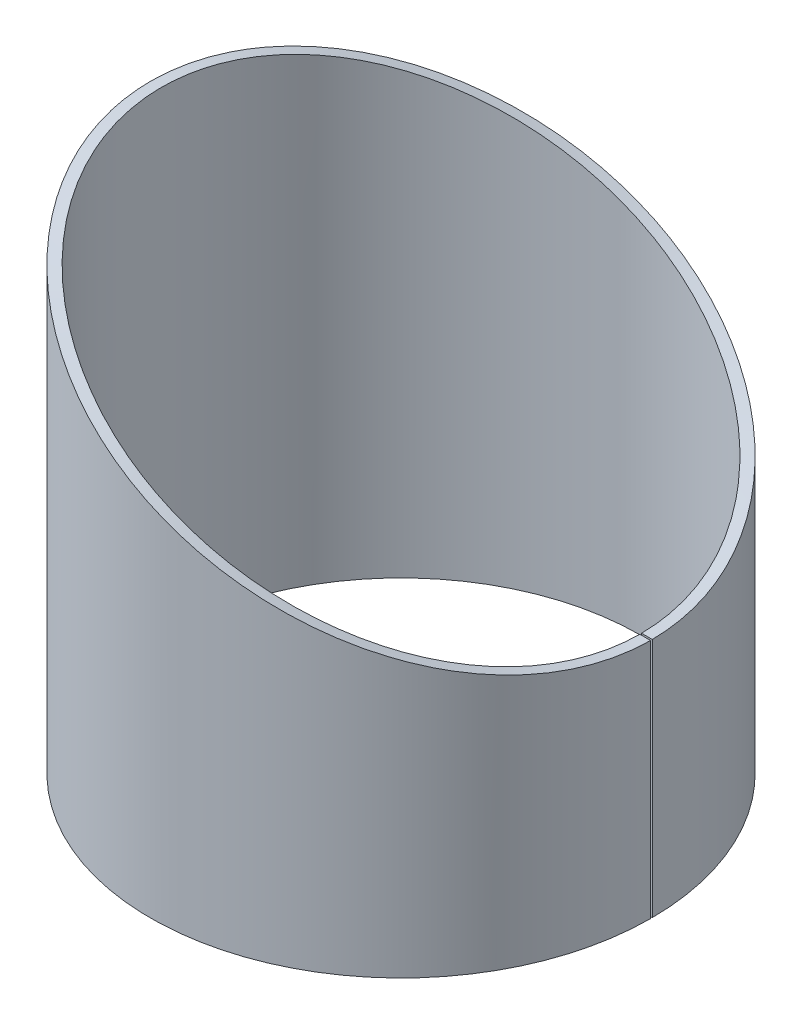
ISO-10303-21;
HEADER;
FILE_DESCRIPTION(('STEP AP214'),'2;1');
FILE_NAME('part.step','',(''),(''),'','','');
FILE_SCHEMA(('AUTOMOTIVE_DESIGN { 1 0 10303 214 1 1 1 1 }'));
ENDSEC;
DATA;
#1=APPLICATION_CONTEXT('core data for automotive mechanical design processes');
#2=APPLICATION_PROTOCOL_DEFINITION('international standard','automotive_design',2000,#1);
#3=PRODUCT_CONTEXT('',#1,'mechanical');
#4=PRODUCT('Part','Part','',(#3));
#5=PRODUCT_RELATED_PRODUCT_CATEGORY('part','',(#4));
#6=PRODUCT_DEFINITION_FORMATION('','',#4);
#7=PRODUCT_DEFINITION_CONTEXT('part definition',#1,'design');
#8=PRODUCT_DEFINITION('design','',#6,#7);
#9=PRODUCT_DEFINITION_SHAPE('','',#8);
#10=(LENGTH_UNIT() NAMED_UNIT(*) SI_UNIT(.MILLI.,.METRE.));
#11=(NAMED_UNIT(*) PLANE_ANGLE_UNIT() SI_UNIT($,.RADIAN.));
#12=(NAMED_UNIT(*) SI_UNIT($,.STERADIAN.) SOLID_ANGLE_UNIT());
#13=UNCERTAINTY_MEASURE_WITH_UNIT(LENGTH_MEASURE(1.E-05),#10,'distance_accuracy_value','');
#14=(GEOMETRIC_REPRESENTATION_CONTEXT(3) GLOBAL_UNCERTAINTY_ASSIGNED_CONTEXT((#13)) GLOBAL_UNIT_ASSIGNED_CONTEXT((#10,
#11,#12)) REPRESENTATION_CONTEXT('',''));
#15=CARTESIAN_POINT('',(0.,0.,0.));
#16=DIRECTION('',(0.,0.,1.));
#17=DIRECTION('',(1.,0.,0.));
#18=AXIS2_PLACEMENT_3D('',#15,#16,#17);
#19=CARTESIAN_POINT('',(-300.,-451.729889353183,0.));
#20=DIRECTION('',(0.,1.,0.));
#21=DIRECTION('',(-1.,0.,0.));
#22=AXIS2_PLACEMENT_3D('',#19,#20,#21);
#23=PLANE('',#22);
#24=DIRECTION('',(0.999993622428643,0.,-0.00357142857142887));
#25=VECTOR('',#24,1.);
#26=CARTESIAN_POINT('',(-166.000854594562,-451.729889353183,-0.478571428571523));
#27=LINE('',#26,#25);
#28=CARTESIAN_POINT('',(-166.000854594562,-451.729889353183,-0.478571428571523));
#29=VERTEX_POINT('',#28);
#30=CARTESIAN_POINT('',(-160.00089285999,-451.729889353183,-0.500000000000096));
#31=VERTEX_POINT('',#30);
#32=EDGE_CURVE('E13',#29,#31,#27,.T.);
#33=ORIENTED_EDGE('',*,*,#32,.F.);
#34=CARTESIAN_POINT('',(-300.,-451.729889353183,0.));
#35=DIRECTION('',(0.,-1.,0.));
#36=DIRECTION('',(1.,0.,0.));
#37=AXIS2_PLACEMENT_3D('',#34,#35,#36);
#38=CIRCLE('',#37,134.);
#39=CARTESIAN_POINT('',(-166.000854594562,-451.729889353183,0.478571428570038));
#40=VERTEX_POINT('',#39);
#41=EDGE_CURVE('E162',#40,#29,#38,.T.);
#42=ORIENTED_EDGE('',*,*,#41,.F.);
#43=DIRECTION('',(0.999993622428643,0.,0.0035714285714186));
#44=VECTOR('',#43,1.);
#45=CARTESIAN_POINT('',(-166.000854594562,-451.729889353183,0.478571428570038));
#46=LINE('',#45,#44);
#47=CARTESIAN_POINT('',(-160.00089285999,-451.729889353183,0.49999999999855));
#48=VERTEX_POINT('',#47);
#49=EDGE_CURVE('E48',#40,#48,#46,.T.);
#50=ORIENTED_EDGE('',*,*,#49,.T.);
#51=CARTESIAN_POINT('',(-300.,-451.729889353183,0.));
#52=DIRECTION('',(0.,-1.,0.));
#53=DIRECTION('',(1.,0.,0.));
#54=AXIS2_PLACEMENT_3D('',#51,#52,#53);
#55=CIRCLE('',#54,140.);
#56=EDGE_CURVE('E101',#48,#31,#55,.T.);
#57=ORIENTED_EDGE('',*,*,#56,.T.);
#58=EDGE_LOOP('',(#33,#42,#50,#57));
#59=FACE_BOUND('',#58,.T.);
#60=ADVANCED_FACE('F36',(#59),#23,.F.);
#61=CARTESIAN_POINT('',(-166.000854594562,-384.371217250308,0.478571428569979));
#62=DIRECTION('',(-0.00357142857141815,0.,0.999993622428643));
#63=DIRECTION('',(0.,-1.,0.));
#64=AXIS2_PLACEMENT_3D('',#61,#62,#63);
#65=PLANE('',#64);
#66=ORIENTED_EDGE('',*,*,#49,.F.);
#67=DIRECTION('',(0.,-1.,0.));
#68=VECTOR('',#67,1.);
#69=CARTESIAN_POINT('',(-166.000854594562,-317.012545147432,0.478571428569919));
#70=LINE('',#69,#68);
#71=CARTESIAN_POINT('',(-166.000854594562,-317.012545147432,0.478571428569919));
#72=VERTEX_POINT('',#71);
#73=EDGE_CURVE('E85',#72,#40,#70,.T.);
#74=ORIENTED_EDGE('',*,*,#73,.F.);
#75=CARTESIAN_POINT('',(-160.00089285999,-317.012545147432,0.499999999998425));
#76=CARTESIAN_POINT('',(-166.000854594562,-317.012545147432,0.478571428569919));
#77=B_SPLINE_CURVE_WITH_KNOTS('',1,(#75,#76),.UNSPECIFIED.,.F.,.F.,(2,2),(0.,1.),.UNSPECIFIED.);
#78=CARTESIAN_POINT('',(-160.00089285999,-317.012545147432,0.499999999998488));
#79=VERTEX_POINT('',#78);
#80=EDGE_CURVE('E80',#72,#79,#77,.F.);
#81=ORIENTED_EDGE('',*,*,#80,.T.);
#82=DIRECTION('',(0.,-1.,0.));
#83=VECTOR('',#82,1.);
#84=CARTESIAN_POINT('',(-160.000892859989,564.8870215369,0.499999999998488));
#85=LINE('',#84,#83);
#86=EDGE_CURVE('E84',#79,#48,#85,.T.);
#87=ORIENTED_EDGE('',*,*,#86,.T.);
#88=EDGE_LOOP('',(#66,#74,#81,#87));
#89=FACE_BOUND('',#88,.T.);
#90=ADVANCED_FACE('F83',(#89),#65,.F.);
#91=CARTESIAN_POINT('',(-160.00089285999,-317.012545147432,0.499999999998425));
#92=CARTESIAN_POINT('',(-160.003681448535,-317.010181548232,1.28079981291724));
#93=CARTESIAN_POINT('',(-160.012020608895,-317.007396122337,1.88273534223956));
#94=CARTESIAN_POINT('',(-160.025959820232,-317.000981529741,2.72894524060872));
#95=CARTESIAN_POINT('',(-160.034927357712,-316.996716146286,3.15822849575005));
#96=CARTESIAN_POINT('',(-160.057698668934,-316.986020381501,4.04329879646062));
#97=CARTESIAN_POINT('',(-160.071543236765,-316.979593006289,4.4978804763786));
#98=CARTESIAN_POINT('',(-160.103472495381,-316.964714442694,5.40051229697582));
#99=CARTESIAN_POINT('',(-160.121630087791,-316.95624800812,5.85201192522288));
#100=CARTESIAN_POINT('',(-160.223416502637,-316.908780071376,8.11032130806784));
#101=CARTESIAN_POINT('',(-160.340074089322,-316.854380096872,9.91906503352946));
#102=CARTESIAN_POINT('',(-160.795280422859,-316.642115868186,15.335484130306));
#103=CARTESIAN_POINT('',(-161.239156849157,-316.435094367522,18.9380432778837));
#104=CARTESIAN_POINT('',(-162.409285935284,-315.889456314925,26.1154452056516));
#105=CARTESIAN_POINT('',(-163.13469652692,-315.551264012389,29.6861248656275));
#106=CARTESIAN_POINT('',(-164.871436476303,-314.74114696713,36.7919641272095));
#107=CARTESIAN_POINT('',(-165.882923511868,-314.269301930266,40.3264500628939));
#108=CARTESIAN_POINT('',(-168.193136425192,-313.192038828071,47.3345908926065));
#109=CARTESIAN_POINT('',(-169.491866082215,-312.58662076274,50.8082403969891));
#110=CARTESIAN_POINT('',(-172.375531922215,-311.24221160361,57.6701435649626));
#111=CARTESIAN_POINT('',(-173.961567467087,-310.502469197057,61.0620111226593));
#112=CARTESIAN_POINT('',(-177.435954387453,-308.882015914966,67.7665876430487));
#113=CARTESIAN_POINT('',(-179.322748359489,-308.002148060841,71.0754222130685));
#114=CARTESIAN_POINT('',(-183.395795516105,-306.103129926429,77.5768921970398));
#115=CARTESIAN_POINT('',(-185.577767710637,-305.085968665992,80.7640638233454));
#116=CARTESIAN_POINT('',(-192.605276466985,-301.808548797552,90.1526391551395));
#117=CARTESIAN_POINT('',(-197.939905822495,-299.321032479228,96.1843158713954));
#118=CARTESIAN_POINT('',(-209.90803709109,-293.740747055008,107.476153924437));
#119=CARTESIAN_POINT('',(-216.650862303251,-290.595634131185,112.839204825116));
#120=CARTESIAN_POINT('',(-226.034714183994,-286.220530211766,118.887012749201));
#121=CARTESIAN_POINT('',(-227.963925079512,-285.32084452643,120.067181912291));
#122=CARTESIAN_POINT('',(-231.959795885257,-283.457176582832,122.375875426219));
#123=CARTESIAN_POINT('',(-234.021961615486,-282.495376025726,123.501455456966));
#124=CARTESIAN_POINT('',(-238.275476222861,-280.511841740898,125.681320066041));
#125=CARTESIAN_POINT('',(-240.466829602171,-279.490108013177,126.735602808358));
#126=CARTESIAN_POINT('',(-244.978350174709,-277.386707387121,128.758415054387));
#127=CARTESIAN_POINT('',(-247.293450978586,-276.307371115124,129.725006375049));
#128=CARTESIAN_POINT('',(-252.072792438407,-274.078684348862,131.565726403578));
#129=CARTESIAN_POINT('',(-254.557793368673,-272.919852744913,132.447552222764));
#130=CARTESIAN_POINT('',(-258.428688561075,-271.11487300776,133.692419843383));
#131=CARTESIAN_POINT('',(-259.742867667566,-270.502091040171,134.094382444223));
#132=CARTESIAN_POINT('',(-262.418815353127,-269.254282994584,134.86880538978));
#133=CARTESIAN_POINT('',(-263.789692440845,-268.614984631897,135.243998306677));
#134=CARTESIAN_POINT('',(-268.026111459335,-266.63941791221,136.331112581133));
#135=CARTESIAN_POINT('',(-271.005357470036,-265.250290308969,137.001741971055));
#136=CARTESIAN_POINT('',(-277.272635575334,-262.327868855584,138.179714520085));
#137=CARTESIAN_POINT('',(-280.747457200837,-260.707319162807,138.723463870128));
#138=CARTESIAN_POINT('',(-285.057768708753,-258.697527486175,139.201156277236));
#139=CARTESIAN_POINT('',(-285.542178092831,-258.471658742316,139.252338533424));
#140=CARTESIAN_POINT('',(-286.277007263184,-258.129017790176,139.326020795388));
#141=CARTESIAN_POINT('',(-286.52331945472,-258.014164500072,139.350066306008));
#142=CARTESIAN_POINT('',(-287.018679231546,-257.783178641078,139.397084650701));
#143=CARTESIAN_POINT('',(-287.264616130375,-257.668499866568,139.419789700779));
#144=CARTESIAN_POINT('',(-288.560999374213,-257.063923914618,139.535778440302));
#145=CARTESIAN_POINT('',(-289.783898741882,-256.493436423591,139.633898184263));
#146=CARTESIAN_POINT('',(-292.602661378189,-255.178807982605,139.811564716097));
#147=CARTESIAN_POINT('',(-294.198569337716,-254.434667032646,139.891110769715));
#148=CARTESIAN_POINT('',(-296.87212729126,-253.188215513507,139.967893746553));
#149=CARTESIAN_POINT('',(-297.809913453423,-252.751024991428,139.986329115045));
#150=CARTESIAN_POINT('',(-299.28628712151,-252.062679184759,139.999045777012));
#151=CARTESIAN_POINT('',(-299.792218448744,-251.826777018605,140.000785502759));
#152=CARTESIAN_POINT('',(-300.818109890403,-251.348401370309,139.998549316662));
#153=CARTESIAN_POINT('',(-301.319851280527,-251.114459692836,139.994637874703));
#154=CARTESIAN_POINT('',(-305.734448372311,-249.056199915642,139.937547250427));
#155=CARTESIAN_POINT('',(-308.938194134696,-247.562389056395,139.736589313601));
#156=CARTESIAN_POINT('',(-312.041722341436,-246.11481721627,139.482560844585));
#157=CARTESIAN_POINT('',(-312.617446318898,-245.846287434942,139.431288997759));
#158=CARTESIAN_POINT('',(-313.679134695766,-245.351197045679,139.331136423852));
#159=CARTESIAN_POINT('',(-314.194134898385,-245.111062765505,139.279551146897));
#160=CARTESIAN_POINT('',(-315.735236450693,-244.392472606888,139.116748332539));
#161=CARTESIAN_POINT('',(-316.738719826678,-243.924580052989,138.999245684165));
#162=CARTESIAN_POINT('',(-319.677226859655,-242.554405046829,138.624337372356));
#163=CARTESIAN_POINT('',(-321.540262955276,-241.685625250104,138.344602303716));
#164=CARTESIAN_POINT('',(-325.074604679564,-240.037406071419,137.747871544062));
#165=CARTESIAN_POINT('',(-326.73026008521,-239.265356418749,137.434484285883));
#166=CARTESIAN_POINT('',(-331.597035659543,-236.996063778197,136.428019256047));
#167=CARTESIAN_POINT('',(-334.669650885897,-235.563249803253,135.672707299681));
#168=CARTESIAN_POINT('',(-339.020977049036,-233.534100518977,134.460516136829));
#169=CARTESIAN_POINT('',(-340.429132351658,-232.877485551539,134.043265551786));
#170=CARTESIAN_POINT('',(-343.202854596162,-231.58412040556,133.17516711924));
#171=CARTESIAN_POINT('',(-344.563012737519,-230.949885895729,132.725769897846));
#172=CARTESIAN_POINT('',(-347.229846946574,-229.706313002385,131.800355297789));
#173=CARTESIAN_POINT('',(-348.536523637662,-229.096974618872,131.324338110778));
#174=CARTESIAN_POINT('',(-351.096512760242,-227.903193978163,130.349615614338));
#175=CARTESIAN_POINT('',(-352.348583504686,-227.319344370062,129.851523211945));
#176=CARTESIAN_POINT('',(-358.532650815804,-224.43600313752,127.289454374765));
#177=CARTESIAN_POINT('',(-363.190906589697,-222.26426606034,125.027082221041));
#178=CARTESIAN_POINT('',(-369.741726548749,-219.20906430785,121.417902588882));
#179=CARTESIAN_POINT('',(-371.852762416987,-218.2243977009,120.178803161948));
#180=CARTESIAN_POINT('',(-375.931217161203,-216.322532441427,117.644440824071));
#181=CARTESIAN_POINT('',(-377.904729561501,-215.402523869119,116.345788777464));
#182=CARTESIAN_POINT('',(-383.67894108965,-212.710435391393,112.337850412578));
#183=CARTESIAN_POINT('',(-387.31263913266,-211.015963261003,109.529207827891));
#184=CARTESIAN_POINT('',(-394.148904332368,-207.827526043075,103.711755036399));
#185=CARTESIAN_POINT('',(-397.343111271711,-206.338085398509,100.71261344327));
#186=CARTESIAN_POINT('',(-403.375119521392,-203.52577870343,94.5108273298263));
#187=CARTESIAN_POINT('',(-406.207139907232,-202.205215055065,91.311417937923));
#188=CARTESIAN_POINT('',(-411.503076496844,-199.735267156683,84.7631732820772));
#189=CARTESIAN_POINT('',(-413.962989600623,-198.588001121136,81.4205965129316));
#190=CARTESIAN_POINT('',(-418.541141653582,-196.453546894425,74.5980848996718));
#191=CARTESIAN_POINT('',(-420.661062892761,-195.465186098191,71.1142253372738));
#192=CARTESIAN_POINT('',(-426.511816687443,-192.73670266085,60.4984364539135));
#193=CARTESIAN_POINT('',(-429.728417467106,-191.236763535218,53.2209295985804));
#194=CARTESIAN_POINT('',(-433.588772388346,-189.436876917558,42.0656903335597));
#195=CARTESIAN_POINT('',(-434.712835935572,-188.912593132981,38.3099712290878));
#196=CARTESIAN_POINT('',(-436.636229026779,-188.015382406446,30.7529344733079));
#197=CARTESIAN_POINT('',(-437.435285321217,-187.642772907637,26.9547904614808));
#198=CARTESIAN_POINT('',(-439.356302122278,-186.747373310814,15.4885305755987));
#199=CARTESIAN_POINT('',(-439.997025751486,-186.448211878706,7.76009059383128));
#200=CARTESIAN_POINT('',(-440.00295353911,-186.445432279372,-7.65239999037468));
#201=CARTESIAN_POINT('',(-439.368209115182,-186.741835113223,-15.3810931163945));
#202=CARTESIAN_POINT('',(-437.455985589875,-187.633128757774,-26.8490402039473));
#203=CARTESIAN_POINT('',(-436.65984839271,-188.004359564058,-30.6477958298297));
#204=CARTESIAN_POINT('',(-434.742305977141,-188.898838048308,-38.2061844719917));
#205=CARTESIAN_POINT('',(-433.621143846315,-189.42177586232,-41.9627520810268));
#206=CARTESIAN_POINT('',(-429.769353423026,-191.217685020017,-53.1210456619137));
#207=CARTESIAN_POINT('',(-426.558382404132,-192.714978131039,-60.4009409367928));
#208=CARTESIAN_POINT('',(-420.715945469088,-195.439597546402,-71.0210177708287));
#209=CARTESIAN_POINT('',(-418.598741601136,-196.426697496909,-74.5064760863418));
#210=CARTESIAN_POINT('',(-414.025868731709,-198.558684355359,-81.3325134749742));
#211=CARTESIAN_POINT('',(-411.568816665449,-199.704600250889,-84.6766061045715));
#212=CARTESIAN_POINT('',(-406.278449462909,-202.171953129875,-91.2283928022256));
#213=CARTESIAN_POINT('',(-403.449171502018,-203.49124603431,-94.4297505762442));
#214=CARTESIAN_POINT('',(-397.422515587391,-206.301064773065,-100.635790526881));
#215=CARTESIAN_POINT('',(-394.231239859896,-207.78912613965,-103.63689800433));
#216=CARTESIAN_POINT('',(-387.401536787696,-210.974493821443,-109.458232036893));
#217=CARTESIAN_POINT('',(-383.771262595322,-212.66737222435,-112.268954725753));
#218=CARTESIAN_POINT('',(-378.002391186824,-215.356981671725,-116.28031917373));
#219=CARTESIAN_POINT('',(-376.030421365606,-216.27627827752,-117.580319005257));
#220=CARTESIAN_POINT('',(-371.956896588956,-218.175840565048,-120.116449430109));
#221=CARTESIAN_POINT('',(-369.848407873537,-219.159320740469,-121.356526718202));
#222=CARTESIAN_POINT('',(-363.305461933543,-222.210858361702,-124.96897666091));
#223=CARTESIAN_POINT('',(-358.652768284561,-224.380012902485,-127.233977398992));
#224=CARTESIAN_POINT('',(-352.475961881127,-227.259951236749,-129.800088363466));
#225=CARTESIAN_POINT('',(-351.225481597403,-227.843053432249,-130.298968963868));
#226=CARTESIAN_POINT('',(-348.669629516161,-229.03490340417,-131.27504881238));
#227=CARTESIAN_POINT('',(-347.365026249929,-229.643275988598,-131.751818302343));
#228=CARTESIAN_POINT('',(-344.702341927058,-230.884916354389,-132.678890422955));
#229=CARTESIAN_POINT('',(-343.344260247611,-231.518184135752,-133.129192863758));
#230=CARTESIAN_POINT('',(-340.574686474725,-232.809614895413,-133.999260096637));
#231=CARTESIAN_POINT('',(-339.168488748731,-233.465313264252,-134.417588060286));
#232=CARTESIAN_POINT('',(-334.826739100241,-235.489991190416,-135.632342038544));
#233=CARTESIAN_POINT('',(-331.76052331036,-236.919833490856,-136.389915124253));
#234=CARTESIAN_POINT('',(-326.903274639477,-239.184682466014,-137.400686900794));
#235=CARTESIAN_POINT('',(-325.253099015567,-239.954165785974,-137.7151751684));
#236=CARTESIAN_POINT('',(-321.732475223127,-241.59598831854,-138.314453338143));
#237=CARTESIAN_POINT('',(-319.876302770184,-242.461575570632,-138.595840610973));
#238=CARTESIAN_POINT('',(-316.948059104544,-243.826970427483,-138.97385331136));
#239=CARTESIAN_POINT('',(-315.947991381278,-244.293271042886,-139.092495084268));
#240=CARTESIAN_POINT('',(-314.4119990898,-245.009475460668,-139.257170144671));
#241=CARTESIAN_POINT('',(-313.894020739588,-245.251002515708,-139.309846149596));
#242=CARTESIAN_POINT('',(-312.846128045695,-245.739641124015,-139.41037996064));
#243=CARTESIAN_POINT('',(-312.288240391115,-245.999836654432,-139.461002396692));
#244=CARTESIAN_POINT('',(-309.249113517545,-247.417357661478,-139.715448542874));
#245=CARTESIAN_POINT('',(-306.09904301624,-248.886251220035,-139.920596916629));
#246=CARTESIAN_POINT('',(-301.746591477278,-250.915492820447,-139.989940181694));
#247=CARTESIAN_POINT('',(-301.251778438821,-251.146196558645,-139.995318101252));
#248=CARTESIAN_POINT('',(-300.239785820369,-251.618068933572,-140.000709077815));
#249=CARTESIAN_POINT('',(-299.722276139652,-251.859392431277,-140.000611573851));
#250=CARTESIAN_POINT('',(-298.227192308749,-252.556486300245,-139.992323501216));
#251=CARTESIAN_POINT('',(-297.276780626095,-252.99956618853,-139.976432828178));
#252=CARTESIAN_POINT('',(-294.564936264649,-254.263857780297,-139.906149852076));
#253=CARTESIAN_POINT('',(-292.942960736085,-255.020121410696,-139.829423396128));
#254=CARTESIAN_POINT('',(-290.071142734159,-256.359453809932,-139.654886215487));
#255=CARTESIAN_POINT('',(-288.82125497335,-256.942522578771,-139.55707647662));
#256=CARTESIAN_POINT('',(-287.490605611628,-257.563111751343,-139.440261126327));
#257=CARTESIAN_POINT('',(-287.239344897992,-257.680280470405,-139.417459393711));
#258=CARTESIAN_POINT('',(-286.742295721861,-257.912056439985,-139.371071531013));
#259=CARTESIAN_POINT('',(-286.495138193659,-258.027304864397,-139.347334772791));
#260=CARTESIAN_POINT('',(-285.757771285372,-258.371131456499,-139.274559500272));
#261=CARTESIAN_POINT('',(-285.271667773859,-258.597790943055,-139.223956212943));
#262=CARTESIAN_POINT('',(-280.946092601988,-260.61470214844,-138.751248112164));
#263=CARTESIAN_POINT('',(-277.452929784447,-262.243784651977,-138.209438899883));
#264=CARTESIAN_POINT('',(-271.167938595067,-265.174494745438,-137.036241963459));
#265=CARTESIAN_POINT('',(-268.184448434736,-266.565585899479,-136.368280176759));
#266=CARTESIAN_POINT('',(-262.522536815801,-269.205893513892,-134.922114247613));
#267=CARTESIAN_POINT('',(-259.858506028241,-270.448156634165,-134.149281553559));
#268=CARTESIAN_POINT('',(-254.688245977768,-272.859021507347,-132.492317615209));
#269=CARTESIAN_POINT('',(-252.198824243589,-274.019910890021,-131.611640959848));
#270=CARTESIAN_POINT('',(-247.41090278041,-276.252603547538,-129.772737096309));
#271=CARTESIAN_POINT('',(-245.093374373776,-277.333079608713,-128.807555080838));
#272=CARTESIAN_POINT('',(-240.575513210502,-279.439431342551,-126.786648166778));
#273=CARTESIAN_POINT('',(-238.381009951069,-280.462627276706,-125.733142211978));
#274=CARTESIAN_POINT('',(-234.121260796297,-282.449059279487,-123.554500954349));
#275=CARTESIAN_POINT('',(-232.056010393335,-283.412295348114,-122.429367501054));
#276=CARTESIAN_POINT('',(-228.054056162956,-285.27880761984,-120.121259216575));
#277=CARTESIAN_POINT('',(-226.121644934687,-286.180003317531,-118.941088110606));
#278=CARTESIAN_POINT('',(-216.725472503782,-290.560894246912,-112.894878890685));
#279=CARTESIAN_POINT('',(-209.973357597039,-293.710290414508,-107.531430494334));
#280=CARTESIAN_POINT('',(-197.988360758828,-299.298449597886,-96.2363255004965));
#281=CARTESIAN_POINT('',(-192.64754332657,-301.788831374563,-90.2034350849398));
#282=CARTESIAN_POINT('',(-185.611104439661,-305.070427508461,-80.8114038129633));
#283=CARTESIAN_POINT('',(-183.426504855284,-306.088815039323,-77.623148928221));
#284=CARTESIAN_POINT('',(-179.348455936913,-307.990161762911,-71.1191812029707));
#285=CARTESIAN_POINT('',(-177.459320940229,-308.871118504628,-67.8089613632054));
#286=CARTESIAN_POINT('',(-173.980585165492,-310.493598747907,-61.1013940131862));
#287=CARTESIAN_POINT('',(-172.392533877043,-311.23428558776,-57.7078948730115));
#288=CARTESIAN_POINT('',(-169.505256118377,-312.580380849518,-50.8427808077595));
#289=CARTESIAN_POINT('',(-168.204869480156,-313.186569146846,-47.3674194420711));
#290=CARTESIAN_POINT('',(-165.891656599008,-314.2652270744,-40.3556821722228));
#291=CARTESIAN_POINT('',(-164.878826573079,-314.737696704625,-36.8193116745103));
#292=CARTESIAN_POINT('',(-163.139725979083,-315.548917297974,-29.7095711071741));
#293=CARTESIAN_POINT('',(-162.413303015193,-315.887584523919,-26.1369139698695));
#294=CARTESIAN_POINT('',(-161.241444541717,-316.434025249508,-18.9552300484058));
#295=CARTESIAN_POINT('',(-160.79687767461,-316.641372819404,-15.3506674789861));
#296=CARTESIAN_POINT('',(-160.340825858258,-316.854025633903,-9.92991149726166));
#297=CARTESIAN_POINT('',(-160.223892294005,-316.908553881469,-8.11863639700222));
#298=CARTESIAN_POINT('',(-160.121950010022,-316.956111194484,-5.85966423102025));
#299=CARTESIAN_POINT('',(-160.103769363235,-316.964591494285,-5.40818290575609));
#300=CARTESIAN_POINT('',(-160.07180146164,-316.979489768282,-4.50588975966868));
#301=CARTESIAN_POINT('',(-160.058177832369,-316.985882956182,-4.06280180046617));
#302=CARTESIAN_POINT('',(-160.022059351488,-317.002220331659,-2.65630044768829));
#303=CARTESIAN_POINT('',(-160.004910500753,-317.009292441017,-1.62493223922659));
#304=CARTESIAN_POINT('',(-160.00089285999,-317.012545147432,-0.499999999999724));
#305=CARTESIAN_POINT('',(-166.000854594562,-317.012545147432,0.478571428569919));
#306=CARTESIAN_POINT('',(-166.003523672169,-317.010181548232,1.22590839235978));
#307=CARTESIAN_POINT('',(-166.011505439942,-317.007396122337,1.802046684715));
#308=CARTESIAN_POINT('',(-166.024847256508,-317.000981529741,2.61199044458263));
#309=CARTESIAN_POINT('',(-166.033430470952,-316.996716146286,3.02287584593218));
#310=CARTESIAN_POINT('',(-166.055225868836,-316.986020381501,3.87001456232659));
#311=CARTESIAN_POINT('',(-166.068477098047,-316.979593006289,4.30511417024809));
#312=CARTESIAN_POINT('',(-166.099037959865,-316.964714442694,5.16906176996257));
#313=CARTESIAN_POINT('',(-166.116417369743,-316.95624800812,5.6012114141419));
#314=CARTESIAN_POINT('',(-166.213841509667,-316.908780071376,7.76273610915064));
#315=CARTESIAN_POINT('',(-166.325499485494,-316.854380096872,9.49396224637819));
#316=CARTESIAN_POINT('',(-166.761196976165,-316.642115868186,14.6782490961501));
#317=CARTESIAN_POINT('',(-167.186050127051,-316.435094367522,18.1264128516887));
#318=CARTESIAN_POINT('',(-168.306030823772,-315.889456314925,24.9962118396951));
#319=CARTESIAN_POINT('',(-169.000352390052,-315.551264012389,28.4138623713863));
#320=CARTESIAN_POINT('',(-170.662660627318,-314.74114696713,35.2151656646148));
#321=CARTESIAN_POINT('',(-171.630798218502,-314.269301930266,38.598173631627));
#322=CARTESIAN_POINT('',(-173.842002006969,-313.192038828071,45.3059655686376));
#323=CARTESIAN_POINT('',(-175.085071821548,-312.58662076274,48.6307443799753));
#324=CARTESIAN_POINT('',(-177.845151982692,-311.24221160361,55.198565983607));
#325=CARTESIAN_POINT('',(-179.36321457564,-310.502469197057,58.4450677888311));
#326=CARTESIAN_POINT('',(-182.688699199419,-308.882015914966,64.8623053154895));
#327=CARTESIAN_POINT('',(-184.494630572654,-308.002148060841,68.0293326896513));
#328=CARTESIAN_POINT('',(-188.393118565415,-306.103129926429,74.2521682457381));
#329=CARTESIAN_POINT('',(-190.481577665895,-305.085968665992,77.3027468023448));
#330=CARTESIAN_POINT('',(-197.207907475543,-301.808548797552,86.2889546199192));
#331=CARTESIAN_POINT('',(-202.313909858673,-299.321032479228,92.0621309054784));
#332=CARTESIAN_POINT('',(-213.769121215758,-293.740747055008,102.870033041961));
#333=CARTESIAN_POINT('',(-220.222968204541,-290.595634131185,108.00323890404));
#334=CARTESIAN_POINT('',(-229.20465500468,-286.220530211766,113.79185505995));
#335=CARTESIAN_POINT('',(-231.051185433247,-285.32084452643,114.921445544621));
#336=CARTESIAN_POINT('',(-234.875804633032,-283.457176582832,117.13119505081));
#337=CARTESIAN_POINT('',(-236.849591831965,-282.495376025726,118.208535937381));
#338=CARTESIAN_POINT('',(-240.920812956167,-280.511841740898,120.294977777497));
#339=CARTESIAN_POINT('',(-243.018251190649,-279.490108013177,121.304076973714));
#340=CARTESIAN_POINT('',(-247.336420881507,-277.386707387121,123.240197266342));
#341=CARTESIAN_POINT('',(-249.552303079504,-276.307371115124,124.16536324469));
#342=CARTESIAN_POINT('',(-254.126815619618,-274.078684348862,125.927195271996));
#343=CARTESIAN_POINT('',(-256.505316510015,-272.919852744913,126.771228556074));
#344=CARTESIAN_POINT('',(-260.210316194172,-271.11487300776,127.962744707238));
#345=CARTESIAN_POINT('',(-261.468173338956,-270.502091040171,128.347480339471));
#346=CARTESIAN_POINT('',(-264.029437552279,-269.254282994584,129.088713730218));
#347=CARTESIAN_POINT('',(-265.341562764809,-268.614984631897,129.447826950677));
#348=CARTESIAN_POINT('',(-269.396420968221,-266.63941791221,130.48835061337));
#349=CARTESIAN_POINT('',(-272.247985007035,-265.250290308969,131.130238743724));
#350=CARTESIAN_POINT('',(-278.246665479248,-262.327868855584,132.257726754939));
#351=CARTESIAN_POINT('',(-281.572566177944,-260.707319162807,132.778172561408));
#352=CARTESIAN_POINT('',(-285.698150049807,-258.697527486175,133.235392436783));
#353=CARTESIAN_POINT('',(-286.161799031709,-258.471658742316,133.284381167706));
#354=CARTESIAN_POINT('',(-286.865135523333,-258.129017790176,133.354905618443));
#355=CARTESIAN_POINT('',(-287.10089147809,-258.014164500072,133.377920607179));
#356=CARTESIAN_POINT('',(-287.575021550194,-257.783178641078,133.422923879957));
#357=CARTESIAN_POINT('',(-287.810418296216,-257.668499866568,133.44465585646));
#358=CARTESIAN_POINT('',(-289.051242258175,-257.063923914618,133.555673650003));
#359=CARTESIAN_POINT('',(-290.221731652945,-256.493436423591,133.64958826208));
#360=CARTESIAN_POINT('',(-292.919690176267,-255.178807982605,133.819640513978));
#361=CARTESIAN_POINT('',(-294.447202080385,-254.434667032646,133.895777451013));
#362=CARTESIAN_POINT('',(-297.006178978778,-253.188215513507,133.969269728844));
#363=CARTESIAN_POINT('',(-297.903774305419,-252.751024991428,133.986915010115));
#364=CARTESIAN_POINT('',(-299.316874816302,-252.062679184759,133.999086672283));
#365=CARTESIAN_POINT('',(-299.80112337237,-251.826777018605,134.000751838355));
#366=CARTESIAN_POINT('',(-300.783048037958,-251.348401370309,133.998611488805));
#367=CARTESIAN_POINT('',(-301.263286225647,-251.114459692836,133.994867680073));
#368=CARTESIAN_POINT('',(-305.488686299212,-249.056199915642,133.940223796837));
#369=CARTESIAN_POINT('',(-308.55512867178,-247.562389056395,133.747878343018));
#370=CARTESIAN_POINT('',(-311.525648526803,-246.11481721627,133.504736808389));
#371=CARTESIAN_POINT('',(-312.076698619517,-245.846287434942,133.455662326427));
#372=CARTESIAN_POINT('',(-313.092886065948,-245.351197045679,133.359802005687));
#373=CARTESIAN_POINT('',(-313.585814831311,-245.111062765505,133.310427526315));
#374=CARTESIAN_POINT('',(-315.060869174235,-244.392472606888,133.15460197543));
#375=CARTESIAN_POINT('',(-316.02134611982,-243.924580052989,133.042135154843));
#376=CARTESIAN_POINT('',(-318.833917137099,-242.554405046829,132.683294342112));
#377=CARTESIAN_POINT('',(-320.617108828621,-241.685625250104,132.415547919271));
#378=CARTESIAN_POINT('',(-323.999978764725,-240.037406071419,131.844391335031));
#379=CARTESIAN_POINT('',(-325.584677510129,-239.265356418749,131.544434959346));
#380=CARTESIAN_POINT('',(-330.24287698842,-236.996063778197,130.581104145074));
#381=CARTESIAN_POINT('',(-333.183808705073,-235.563249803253,129.858162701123));
#382=CARTESIAN_POINT('',(-337.34864946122,-233.534100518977,128.697922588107));
#383=CARTESIAN_POINT('',(-338.696455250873,-232.877485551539,128.298554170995));
#384=CARTESIAN_POINT('',(-341.351303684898,-231.58412040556,127.467659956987));
#385=CARTESIAN_POINT('',(-342.653169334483,-230.949885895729,127.037522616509));
#386=CARTESIAN_POINT('',(-345.205710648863,-229.706313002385,126.151768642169));
#387=CARTESIAN_POINT('',(-346.456386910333,-229.096974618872,125.696152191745));
#388=CARTESIAN_POINT('',(-348.906662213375,-227.903193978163,124.763203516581));
#389=CARTESIAN_POINT('',(-350.105072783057,-227.319344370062,124.286457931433));
#390=CARTESIAN_POINT('',(-356.024108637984,-224.43600313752,121.834192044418));
#391=CARTESIAN_POINT('',(-360.48272487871,-222.26426606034,119.668778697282));
#392=CARTESIAN_POINT('',(-366.752795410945,-219.20906430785,116.214278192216));
#393=CARTESIAN_POINT('',(-368.773358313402,-218.2243977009,115.028283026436));
#394=CARTESIAN_POINT('',(-372.677022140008,-216.322532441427,112.602536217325));
#395=CARTESIAN_POINT('',(-374.565955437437,-215.402523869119,111.359540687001));
#396=CARTESIAN_POINT('',(-380.092700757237,-212.710435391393,107.523371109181));
#397=CARTESIAN_POINT('',(-383.570668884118,-211.015963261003,104.835098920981));
#398=CARTESIAN_POINT('',(-390.113951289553,-207.827526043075,99.2669655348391));
#399=CARTESIAN_POINT('',(-393.171263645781,-206.338085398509,96.3963585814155));
#400=CARTESIAN_POINT('',(-398.944757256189,-203.52577870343,90.4603633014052));
#401=CARTESIAN_POINT('',(-401.65540533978,-202.205215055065,87.3980714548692));
#402=CARTESIAN_POINT('',(-406.724373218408,-199.735267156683,81.1304658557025));
#403=CARTESIAN_POINT('',(-409.078861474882,-198.588001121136,77.9311423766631));
#404=CARTESIAN_POINT('',(-413.460807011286,-196.453546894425,71.4010241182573));
#405=CARTESIAN_POINT('',(-415.489874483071,-195.465186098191,68.0664728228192));
#406=CARTESIAN_POINT('',(-421.089881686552,-192.73670266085,57.9056463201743));
#407=CARTESIAN_POINT('',(-424.168628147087,-191.236763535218,50.9400326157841));
#408=CARTESIAN_POINT('',(-427.863539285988,-189.436876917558,40.26287503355));
#409=CARTESIAN_POINT('',(-428.93942868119,-188.912593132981,36.6681153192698));
#410=CARTESIAN_POINT('',(-430.780390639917,-188.015382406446,29.434951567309));
#411=CARTESIAN_POINT('',(-431.545201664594,-187.642772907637,25.7995851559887));
#412=CARTESIAN_POINT('',(-433.38388917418,-186.747373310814,14.824736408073));
#413=CARTESIAN_POINT('',(-433.99715321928,-186.448211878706,7.42751528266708));
#414=CARTESIAN_POINT('',(-434.002826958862,-186.445432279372,-7.3244399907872));
#415=CARTESIAN_POINT('',(-433.395285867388,-186.741835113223,-14.7219034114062));
#416=CARTESIAN_POINT('',(-431.56501477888,-187.633128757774,-25.6983670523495));
#417=CARTESIAN_POINT('',(-430.802997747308,-188.004359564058,-29.3343188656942));
#418=CARTESIAN_POINT('',(-428.967635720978,-188.898838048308,-36.5687765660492));
#419=CARTESIAN_POINT('',(-427.894523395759,-189.42177586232,-40.1643484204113));
#420=CARTESIAN_POINT('',(-424.207809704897,-191.217685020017,-50.8444294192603));
#421=CARTESIAN_POINT('',(-421.134451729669,-192.714978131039,-57.8123291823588));
#422=CARTESIAN_POINT('',(-415.542404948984,-195.439597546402,-67.9772598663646));
#423=CARTESIAN_POINT('',(-413.515938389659,-196.426697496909,-71.3133413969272));
#424=CARTESIAN_POINT('',(-409.139045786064,-198.558684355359,-77.8468343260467));
#425=CARTESIAN_POINT('',(-406.787295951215,-199.704600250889,-81.0476087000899));
#426=CARTESIAN_POINT('',(-401.723658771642,-202.171953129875,-87.3186045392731));
#427=CARTESIAN_POINT('',(-399.015635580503,-203.49124603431,-90.3827612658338));
#428=CARTESIAN_POINT('',(-393.24726491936,-206.301064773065,-96.3228280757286));
#429=CARTESIAN_POINT('',(-390.192758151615,-207.78912613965,-99.1953166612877));
#430=CARTESIAN_POINT('',(-383.655756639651,-210.974493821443,-104.767164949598));
#431=CARTESIAN_POINT('',(-380.181065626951,-212.66737222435,-107.45742809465));
#432=CARTESIAN_POINT('',(-374.659431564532,-215.356981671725,-111.296876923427));
#433=CARTESIAN_POINT('',(-372.771974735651,-216.27627827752,-112.54116247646));
#434=CARTESIAN_POINT('',(-368.873029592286,-218.175840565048,-114.96860159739));
#435=CARTESIAN_POINT('',(-366.854904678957,-219.159320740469,-116.155532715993));
#436=CARTESIAN_POINT('',(-360.59237070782,-222.210858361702,-119.613163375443));
#437=CARTESIAN_POINT('',(-356.139078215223,-224.380012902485,-121.781092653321));
#438=CARTESIAN_POINT('',(-350.226992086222,-227.259951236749,-124.237227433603));
#439=CARTESIAN_POINT('',(-349.030103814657,-227.843053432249,-124.714727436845));
#440=CARTESIAN_POINT('',(-346.583788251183,-229.03490340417,-125.648975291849));
#441=CARTESIAN_POINT('',(-345.335096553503,-229.643275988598,-126.105311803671));
#442=CARTESIAN_POINT('',(-342.786527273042,-230.884916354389,-126.992652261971));
#443=CARTESIAN_POINT('',(-341.486649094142,-231.518184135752,-127.42365602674));
#444=CARTESIAN_POINT('',(-338.835771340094,-232.809614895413,-128.256434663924));
#445=CARTESIAN_POINT('',(-337.489839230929,-233.465313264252,-128.656834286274));
#446=CARTESIAN_POINT('',(-333.334164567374,-235.489991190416,-129.819527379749));
#447=CARTESIAN_POINT('',(-330.39935802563,-236.919833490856,-130.5446330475));
#448=CARTESIAN_POINT('',(-325.750277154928,-239.184682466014,-131.512086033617));
#449=CARTESIAN_POINT('',(-324.170823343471,-239.954165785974,-131.813096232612));
#450=CARTESIAN_POINT('',(-320.80108342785,-241.59598831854,-132.386691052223));
#451=CARTESIAN_POINT('',(-319.02446122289,-242.461575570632,-132.656018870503));
#452=CARTESIAN_POINT('',(-316.221713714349,-243.826970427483,-133.017831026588));
#453=CARTESIAN_POINT('',(-315.264506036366,-244.293271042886,-133.131388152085));
#454=CARTESIAN_POINT('',(-313.794341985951,-245.009475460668,-133.289005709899));
#455=CARTESIAN_POINT('',(-313.298562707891,-245.251002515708,-133.339424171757));
#456=CARTESIAN_POINT('',(-312.29557970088,-245.739641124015,-133.435649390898));
#457=CARTESIAN_POINT('',(-311.76160151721,-245.999836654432,-133.484102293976));
#458=CARTESIAN_POINT('',(-308.852722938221,-247.417357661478,-133.727643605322));
#459=CARTESIAN_POINT('',(-305.837655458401,-248.886251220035,-133.923999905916));
#460=CARTESIAN_POINT('',(-301.671737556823,-250.915492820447,-133.990371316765));
#461=CARTESIAN_POINT('',(-301.198130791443,-251.146196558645,-133.995518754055));
#462=CARTESIAN_POINT('',(-300.229509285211,-251.618068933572,-134.000678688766));
#463=CARTESIAN_POINT('',(-299.73417859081,-251.859392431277,-134.000585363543));
#464=CARTESIAN_POINT('',(-298.303169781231,-252.556486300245,-133.992652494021));
#465=CARTESIAN_POINT('',(-297.393490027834,-252.99956618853,-133.977442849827));
#466=CARTESIAN_POINT('',(-294.797867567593,-254.263857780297,-133.910172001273));
#467=CARTESIAN_POINT('',(-293.245405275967,-255.020121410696,-133.836733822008));
#468=CARTESIAN_POINT('',(-290.49666518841,-256.359453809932,-133.669676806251));
#469=CARTESIAN_POINT('',(-289.300344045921,-256.942522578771,-133.576058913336));
#470=CARTESIAN_POINT('',(-288.026722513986,-257.563111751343,-133.464249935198));
#471=CARTESIAN_POINT('',(-287.78623011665,-257.680280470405,-133.442425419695));
#472=CARTESIAN_POINT('',(-287.310483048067,-257.912056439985,-133.398025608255));
#473=CARTESIAN_POINT('',(-287.073917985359,-258.027304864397,-133.375306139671));
#474=CARTESIAN_POINT('',(-286.368152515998,-258.371131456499,-133.305649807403));
#475=CARTESIAN_POINT('',(-285.902882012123,-258.597790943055,-133.257215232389));
#476=CARTESIAN_POINT('',(-281.762688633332,-260.61470214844,-132.804766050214));
#477=CARTESIAN_POINT('',(-278.419232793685,-262.243784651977,-132.286177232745));
#478=CARTESIAN_POINT('',(-272.403598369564,-265.174494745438,-131.163260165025));
#479=CARTESIAN_POINT('',(-269.547972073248,-266.565585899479,-130.52392531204));
#480=CARTESIAN_POINT('',(-264.12871380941,-269.205893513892,-129.139737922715));
#481=CARTESIAN_POINT('',(-261.578855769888,-270.448156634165,-128.400026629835));
#482=CARTESIAN_POINT('',(-256.630178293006,-272.859021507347,-126.8140754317));
#483=CARTESIAN_POINT('',(-254.24744606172,-274.019910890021,-125.971142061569));
#484=CARTESIAN_POINT('',(-249.664721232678,-276.252603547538,-124.21104836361));
#485=CARTESIAN_POINT('',(-247.446515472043,-277.333079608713,-123.28723129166));
#486=CARTESIAN_POINT('',(-243.122276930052,-279.439431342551,-121.352934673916));
#487=CARTESIAN_POINT('',(-241.021823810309,-280.462627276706,-120.344578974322));
#488=CARTESIAN_POINT('',(-236.944635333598,-282.449059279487,-118.259308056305));
#489=CARTESIAN_POINT('',(-234.967895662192,-283.412295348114,-117.182394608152));
#490=CARTESIAN_POINT('',(-231.137453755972,-285.27880761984,-114.973205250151));
#491=CARTESIAN_POINT('',(-229.287860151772,-286.180003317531,-113.843612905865));
#492=CARTESIAN_POINT('',(-220.294380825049,-290.560894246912,-108.056526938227));
#493=CARTESIAN_POINT('',(-213.831642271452,-293.710290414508,-102.922940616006));
#494=CARTESIAN_POINT('',(-202.360288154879,-299.298449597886,-92.1119115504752));
#495=CARTESIAN_POINT('',(-197.248362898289,-301.788831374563,-86.3375735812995));
#496=CARTESIAN_POINT('',(-190.513485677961,-305.070427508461,-77.3480579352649));
#497=CARTESIAN_POINT('',(-188.422511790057,-306.088815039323,-74.2964425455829));
#498=CARTESIAN_POINT('',(-184.51923639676,-307.990161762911,-68.071216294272));
#499=CARTESIAN_POINT('',(-182.711064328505,-308.871118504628,-64.902863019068));
#500=CARTESIAN_POINT('',(-179.381417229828,-310.493598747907,-58.4827628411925));
#501=CARTESIAN_POINT('',(-177.861425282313,-311.23428558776,-55.2346993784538));
#502=CARTESIAN_POINT('',(-175.097887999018,-312.580380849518,-48.663804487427));
#503=CARTESIAN_POINT('',(-173.853232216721,-313.186569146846,-45.337387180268));
#504=CARTESIAN_POINT('',(-171.63915703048,-314.2652270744,-38.6261529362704));
#505=CARTESIAN_POINT('',(-170.669734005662,-314.737696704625,-35.2413411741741));
#506=CARTESIAN_POINT('',(-169.005166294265,-315.548917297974,-28.4363037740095));
#507=CARTESIAN_POINT('',(-168.309875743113,-315.887584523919,-25.016760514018));
#508=CARTESIAN_POINT('',(-167.188239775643,-316.434025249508,-18.1428630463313));
#509=CARTESIAN_POINT('',(-166.76272577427,-316.641372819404,-14.6927817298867));
#510=CARTESIAN_POINT('',(-166.326219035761,-316.854025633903,-9.50434386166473));
#511=CARTESIAN_POINT('',(-166.214296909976,-316.908553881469,-7.7706948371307));
#512=CARTESIAN_POINT('',(-166.116723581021,-316.956111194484,-5.60853576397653));
#513=CARTESIAN_POINT('',(-166.099322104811,-316.964591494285,-5.17640363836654));
#514=CARTESIAN_POINT('',(-166.068724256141,-316.979489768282,-4.31278019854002));
#515=CARTESIAN_POINT('',(-166.055684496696,-316.985882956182,-3.88868172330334));
#516=CARTESIAN_POINT('',(-166.02111395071,-317.002220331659,-2.54245899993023));
#517=CARTESIAN_POINT('',(-166.004700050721,-317.009292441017,-1.55529228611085));
#518=CARTESIAN_POINT('',(-166.000854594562,-317.012545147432,-0.478571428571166));
#519=B_SPLINE_SURFACE_WITH_KNOTS('',1,3,((#91,#92,#93,#94,#95,#96,#97,#98,#99,#100,#101,#102,
#103,#104,#105,#106,#107,#108,#109,#110,#111,#112,#113,#114,#115,#116,#117,#118,#119,#120,#121,
#122,#123,#124,#125,#126,#127,#128,#129,#130,#131,#132,#133,#134,#135,#136,#137,#138,#139,#140,
#141,#142,#143,#144,#145,#146,#147,#148,#149,#150,#151,#152,#153,#154,#155,#156,#157,#158,#159,
#160,#161,#162,#163,#164,#165,#166,#167,#168,#169,#170,#171,#172,#173,#174,#175,#176,#177,#178,
#179,#180,#181,#182,#183,#184,#185,#186,#187,#188,#189,#190,#191,#192,#193,#194,#195,#196,#197,
#198,#199,#200,#201,#202,#203,#204,#205,#206,#207,#208,#209,#210,#211,#212,#213,#214,#215,#216,
#217,#218,#219,#220,#221,#222,#223,#224,#225,#226,#227,#228,#229,#230,#231,#232,#233,#234,#235,
#236,#237,#238,#239,#240,#241,#242,#243,#244,#245,#246,#247,#248,#249,#250,#251,#252,#253,#254,
#255,#256,#257,#258,#259,#260,#261,#262,#263,#264,#265,#266,#267,#268,#269,#270,#271,#272,#273,
#274,#275,#276,#277,#278,#279,#280,#281,#282,#283,#284,#285,#286,#287,#288,#289,#290,#291,#292,
#293,#294,#295,#296,#297,#298,#299,#300,#301,#302,#303,#304),(#305,#306,#307,#308,#309,#310,
#311,#312,#313,#314,#315,#316,#317,#318,#319,#320,#321,#322,#323,#324,#325,#326,#327,#328,#329,
#330,#331,#332,#333,#334,#335,#336,#337,#338,#339,#340,#341,#342,#343,#344,#345,#346,#347,#348,
#349,#350,#351,#352,#353,#354,#355,#356,#357,#358,#359,#360,#361,#362,#363,#364,#365,#366,#367,
#368,#369,#370,#371,#372,#373,#374,#375,#376,#377,#378,#379,#380,#381,#382,#383,#384,#385,#386,
#387,#388,#389,#390,#391,#392,#393,#394,#395,#396,#397,#398,#399,#400,#401,#402,#403,#404,#405,
#406,#407,#408,#409,#410,#411,#412,#413,#414,#415,#416,#417,#418,#419,#420,#421,#422,#423,#424,
#425,#426,#427,#428,#429,#430,#431,#432,#433,#434,#435,#436,#437,#438,#439,#440,#441,#442,#443,
#444,#445,#446,#447,#448,#449,#450,#451,#452,#453,#454,#455,#456,#457,#458,#459,#460,#461,#462,
#463,#464,#465,#466,#467,#468,#469,#470,#471,#472,#473,#474,#475,#476,#477,#478,#479,#480,#481,
#482,#483,#484,#485,#486,#487,#488,#489,#490,#491,#492,#493,#494,#495,#496,#497,#498,#499,#500,
#501,#502,#503,#504,#505,#506,#507,#508,#509,#510,#511,#512,#513,#514,#515,#516,#517,#518)),
.UNSPECIFIED.,.F.,.F.,.F.,(2,2),(4,2,2,2,2,2,2,2,2,2,2,2,2,2,2,2,2,2,2,2,2,2,2,2,2,2,2,2,2,2,2,
2,2,2,2,2,2,2,2,2,2,2,2,2,2,2,2,2,2,2,2,2,2,2,2,2,2,2,2,2,2,2,2,2,2,2,2,2,2,2,2,2,2,2,2,2,2,2,2,
2,2,2,2,2,2,2,2,2,2,2,2,2,2,2,2,2,2,2,2,2,2,2,2,2,2,2,4),(0.,1.),(0.,0.001953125,0.00390625,
0.005859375,0.0078125,0.015625,0.03125,0.046875,0.0625,0.078125,0.09375,0.109375,0.125,0.15625,
0.1875,0.1953125,0.203125,0.2109375,0.21875,0.2265625,0.23046875,0.234375,0.2421875,0.25,
0.2509765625,0.25146484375,0.251953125,0.25390625,0.255859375,0.2568359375,0.25732421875,
0.2578125,0.26171875,0.2626953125,0.263671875,0.265625,0.26953125,0.2734375,0.28125,0.28515625,
0.2890625,0.29296875,0.296875,0.3125,0.3203125,0.328125,0.34375,0.359375,0.375,0.390625,0.40625,
0.4375,0.453125,0.46875,0.5,0.53125,0.546875,0.5625,0.59375,0.609375,0.625,0.640625,0.65625,
0.671875,0.6796875,0.6875,0.703125,0.70703125,0.7109375,0.71484375,0.71875,0.7265625,0.73046875,
0.734375,0.736328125,0.7373046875,0.73828125,0.7421875,0.74267578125,0.7431640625,0.744140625,
0.74609375,0.748046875,0.74853515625,0.7490234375,0.75,0.7578125,0.765625,0.7734375,0.78125,
0.7890625,0.796875,0.8046875,0.8125,0.84375,0.875,0.890625,0.90625,0.921875,0.9375,0.953125,
0.96875,0.984375,0.9921875,0.994140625,0.99609375,1.),.UNSPECIFIED.);
#520=CARTESIAN_POINT('',(-166.000854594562,-317.012545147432,0.478571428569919));
#521=CARTESIAN_POINT('',(-166.003523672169,-317.010181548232,1.22590839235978));
#522=CARTESIAN_POINT('',(-166.011505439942,-317.007396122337,1.802046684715));
#523=CARTESIAN_POINT('',(-166.024847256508,-317.000981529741,2.61199044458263));
#524=CARTESIAN_POINT('',(-166.033430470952,-316.996716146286,3.02287584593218));
#525=CARTESIAN_POINT('',(-166.055225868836,-316.986020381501,3.87001456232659));
#526=CARTESIAN_POINT('',(-166.068477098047,-316.979593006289,4.30511417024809));
#527=CARTESIAN_POINT('',(-166.099037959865,-316.964714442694,5.16906176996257));
#528=CARTESIAN_POINT('',(-166.116417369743,-316.95624800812,5.6012114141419));
#529=CARTESIAN_POINT('',(-166.213841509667,-316.908780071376,7.76273610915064));
#530=CARTESIAN_POINT('',(-166.325499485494,-316.854380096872,9.49396224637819));
#531=CARTESIAN_POINT('',(-166.761196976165,-316.642115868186,14.6782490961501));
#532=CARTESIAN_POINT('',(-167.186050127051,-316.435094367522,18.1264128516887));
#533=CARTESIAN_POINT('',(-168.306030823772,-315.889456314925,24.9962118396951));
#534=CARTESIAN_POINT('',(-169.000352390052,-315.551264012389,28.4138623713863));
#535=CARTESIAN_POINT('',(-170.662660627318,-314.74114696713,35.2151656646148));
#536=CARTESIAN_POINT('',(-171.630798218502,-314.269301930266,38.598173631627));
#537=CARTESIAN_POINT('',(-173.842002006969,-313.192038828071,45.3059655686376));
#538=CARTESIAN_POINT('',(-175.085071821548,-312.58662076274,48.6307443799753));
#539=CARTESIAN_POINT('',(-177.845151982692,-311.24221160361,55.198565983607));
#540=CARTESIAN_POINT('',(-179.36321457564,-310.502469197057,58.4450677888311));
#541=CARTESIAN_POINT('',(-182.688699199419,-308.882015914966,64.8623053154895));
#542=CARTESIAN_POINT('',(-184.494630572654,-308.002148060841,68.0293326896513));
#543=CARTESIAN_POINT('',(-188.393118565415,-306.103129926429,74.2521682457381));
#544=CARTESIAN_POINT('',(-190.481577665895,-305.085968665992,77.3027468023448));
#545=CARTESIAN_POINT('',(-197.207907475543,-301.808548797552,86.2889546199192));
#546=CARTESIAN_POINT('',(-202.313909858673,-299.321032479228,92.0621309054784));
#547=CARTESIAN_POINT('',(-213.769121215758,-293.740747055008,102.870033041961));
#548=CARTESIAN_POINT('',(-220.222968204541,-290.595634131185,108.00323890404));
#549=CARTESIAN_POINT('',(-229.20465500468,-286.220530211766,113.79185505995));
#550=CARTESIAN_POINT('',(-231.051185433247,-285.32084452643,114.921445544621));
#551=CARTESIAN_POINT('',(-234.875804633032,-283.457176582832,117.13119505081));
#552=CARTESIAN_POINT('',(-236.849591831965,-282.495376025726,118.208535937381));
#553=CARTESIAN_POINT('',(-240.920812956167,-280.511841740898,120.294977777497));
#554=CARTESIAN_POINT('',(-243.018251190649,-279.490108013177,121.304076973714));
#555=CARTESIAN_POINT('',(-247.336420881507,-277.386707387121,123.240197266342));
#556=CARTESIAN_POINT('',(-249.552303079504,-276.307371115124,124.16536324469));
#557=CARTESIAN_POINT('',(-254.126815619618,-274.078684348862,125.927195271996));
#558=CARTESIAN_POINT('',(-256.505316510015,-272.919852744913,126.771228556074));
#559=CARTESIAN_POINT('',(-260.210316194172,-271.11487300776,127.962744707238));
#560=CARTESIAN_POINT('',(-261.468173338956,-270.502091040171,128.347480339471));
#561=CARTESIAN_POINT('',(-264.029437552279,-269.254282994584,129.088713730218));
#562=CARTESIAN_POINT('',(-265.341562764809,-268.614984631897,129.447826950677));
#563=CARTESIAN_POINT('',(-269.396420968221,-266.63941791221,130.48835061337));
#564=CARTESIAN_POINT('',(-272.247985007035,-265.250290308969,131.130238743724));
#565=CARTESIAN_POINT('',(-278.246665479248,-262.327868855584,132.257726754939));
#566=CARTESIAN_POINT('',(-281.572566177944,-260.707319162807,132.778172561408));
#567=CARTESIAN_POINT('',(-285.698150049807,-258.697527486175,133.235392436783));
#568=CARTESIAN_POINT('',(-286.161799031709,-258.471658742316,133.284381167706));
#569=CARTESIAN_POINT('',(-286.865135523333,-258.129017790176,133.354905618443));
#570=CARTESIAN_POINT('',(-287.10089147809,-258.014164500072,133.377920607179));
#571=CARTESIAN_POINT('',(-287.575021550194,-257.783178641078,133.422923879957));
#572=CARTESIAN_POINT('',(-287.810418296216,-257.668499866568,133.44465585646));
#573=CARTESIAN_POINT('',(-289.051242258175,-257.063923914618,133.555673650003));
#574=CARTESIAN_POINT('',(-290.221731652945,-256.493436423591,133.64958826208));
#575=CARTESIAN_POINT('',(-292.919690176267,-255.178807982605,133.819640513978));
#576=CARTESIAN_POINT('',(-294.447202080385,-254.434667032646,133.895777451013));
#577=CARTESIAN_POINT('',(-297.006178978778,-253.188215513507,133.969269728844));
#578=CARTESIAN_POINT('',(-297.903774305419,-252.751024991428,133.986915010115));
#579=CARTESIAN_POINT('',(-299.316874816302,-252.062679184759,133.999086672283));
#580=CARTESIAN_POINT('',(-299.80112337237,-251.826777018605,134.000751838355));
#581=CARTESIAN_POINT('',(-300.783048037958,-251.348401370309,133.998611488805));
#582=CARTESIAN_POINT('',(-301.263286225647,-251.114459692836,133.994867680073));
#583=CARTESIAN_POINT('',(-305.488686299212,-249.056199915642,133.940223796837));
#584=CARTESIAN_POINT('',(-308.55512867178,-247.562389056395,133.747878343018));
#585=CARTESIAN_POINT('',(-311.525648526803,-246.11481721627,133.504736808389));
#586=CARTESIAN_POINT('',(-312.076698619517,-245.846287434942,133.455662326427));
#587=CARTESIAN_POINT('',(-313.092886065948,-245.351197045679,133.359802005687));
#588=CARTESIAN_POINT('',(-313.585814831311,-245.111062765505,133.310427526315));
#589=CARTESIAN_POINT('',(-315.060869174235,-244.392472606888,133.15460197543));
#590=CARTESIAN_POINT('',(-316.02134611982,-243.924580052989,133.042135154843));
#591=CARTESIAN_POINT('',(-318.833917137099,-242.554405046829,132.683294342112));
#592=CARTESIAN_POINT('',(-320.617108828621,-241.685625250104,132.415547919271));
#593=CARTESIAN_POINT('',(-323.999978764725,-240.037406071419,131.844391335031));
#594=CARTESIAN_POINT('',(-325.584677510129,-239.265356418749,131.544434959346));
#595=CARTESIAN_POINT('',(-330.24287698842,-236.996063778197,130.581104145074));
#596=CARTESIAN_POINT('',(-333.183808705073,-235.563249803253,129.858162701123));
#597=CARTESIAN_POINT('',(-337.34864946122,-233.534100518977,128.697922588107));
#598=CARTESIAN_POINT('',(-338.696455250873,-232.877485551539,128.298554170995));
#599=CARTESIAN_POINT('',(-341.351303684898,-231.58412040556,127.467659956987));
#600=CARTESIAN_POINT('',(-342.653169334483,-230.949885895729,127.037522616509));
#601=CARTESIAN_POINT('',(-345.205710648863,-229.706313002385,126.151768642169));
#602=CARTESIAN_POINT('',(-346.456386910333,-229.096974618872,125.696152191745));
#603=CARTESIAN_POINT('',(-348.906662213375,-227.903193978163,124.763203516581));
#604=CARTESIAN_POINT('',(-350.105072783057,-227.319344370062,124.286457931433));
#605=CARTESIAN_POINT('',(-356.024108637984,-224.43600313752,121.834192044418));
#606=CARTESIAN_POINT('',(-360.48272487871,-222.26426606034,119.668778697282));
#607=CARTESIAN_POINT('',(-366.752795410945,-219.20906430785,116.214278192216));
#608=CARTESIAN_POINT('',(-368.773358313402,-218.2243977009,115.028283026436));
#609=CARTESIAN_POINT('',(-372.677022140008,-216.322532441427,112.602536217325));
#610=CARTESIAN_POINT('',(-374.565955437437,-215.402523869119,111.359540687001));
#611=CARTESIAN_POINT('',(-380.092700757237,-212.710435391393,107.523371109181));
#612=CARTESIAN_POINT('',(-383.570668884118,-211.015963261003,104.835098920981));
#613=CARTESIAN_POINT('',(-390.113951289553,-207.827526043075,99.2669655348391));
#614=CARTESIAN_POINT('',(-393.171263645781,-206.338085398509,96.3963585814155));
#615=CARTESIAN_POINT('',(-398.944757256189,-203.52577870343,90.4603633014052));
#616=CARTESIAN_POINT('',(-401.65540533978,-202.205215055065,87.3980714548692));
#617=CARTESIAN_POINT('',(-406.724373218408,-199.735267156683,81.1304658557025));
#618=CARTESIAN_POINT('',(-409.078861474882,-198.588001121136,77.9311423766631));
#619=CARTESIAN_POINT('',(-413.460807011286,-196.453546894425,71.4010241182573));
#620=CARTESIAN_POINT('',(-415.489874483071,-195.465186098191,68.0664728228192));
#621=CARTESIAN_POINT('',(-421.089881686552,-192.73670266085,57.9056463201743));
#622=CARTESIAN_POINT('',(-424.168628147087,-191.236763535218,50.9400326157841));
#623=CARTESIAN_POINT('',(-427.863539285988,-189.436876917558,40.26287503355));
#624=CARTESIAN_POINT('',(-428.93942868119,-188.912593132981,36.6681153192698));
#625=CARTESIAN_POINT('',(-430.780390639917,-188.015382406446,29.434951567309));
#626=CARTESIAN_POINT('',(-431.545201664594,-187.642772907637,25.7995851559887));
#627=CARTESIAN_POINT('',(-433.38388917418,-186.747373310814,14.824736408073));
#628=CARTESIAN_POINT('',(-433.99715321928,-186.448211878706,7.42751528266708));
#629=CARTESIAN_POINT('',(-434.002826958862,-186.445432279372,-7.3244399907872));
#630=CARTESIAN_POINT('',(-433.395285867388,-186.741835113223,-14.7219034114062));
#631=CARTESIAN_POINT('',(-431.56501477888,-187.633128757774,-25.6983670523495));
#632=CARTESIAN_POINT('',(-430.802997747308,-188.004359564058,-29.3343188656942));
#633=CARTESIAN_POINT('',(-428.967635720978,-188.898838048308,-36.5687765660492));
#634=CARTESIAN_POINT('',(-427.894523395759,-189.42177586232,-40.1643484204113));
#635=CARTESIAN_POINT('',(-424.207809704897,-191.217685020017,-50.8444294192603));
#636=CARTESIAN_POINT('',(-421.134451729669,-192.714978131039,-57.8123291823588));
#637=CARTESIAN_POINT('',(-415.542404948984,-195.439597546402,-67.9772598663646));
#638=CARTESIAN_POINT('',(-413.515938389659,-196.426697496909,-71.3133413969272));
#639=CARTESIAN_POINT('',(-409.139045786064,-198.558684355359,-77.8468343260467));
#640=CARTESIAN_POINT('',(-406.787295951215,-199.704600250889,-81.0476087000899));
#641=CARTESIAN_POINT('',(-401.723658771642,-202.171953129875,-87.3186045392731));
#642=CARTESIAN_POINT('',(-399.015635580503,-203.49124603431,-90.3827612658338));
#643=CARTESIAN_POINT('',(-393.24726491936,-206.301064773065,-96.3228280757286));
#644=CARTESIAN_POINT('',(-390.192758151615,-207.78912613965,-99.1953166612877));
#645=CARTESIAN_POINT('',(-383.655756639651,-210.974493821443,-104.767164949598));
#646=CARTESIAN_POINT('',(-380.181065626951,-212.66737222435,-107.45742809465));
#647=CARTESIAN_POINT('',(-374.659431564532,-215.356981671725,-111.296876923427));
#648=CARTESIAN_POINT('',(-372.771974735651,-216.27627827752,-112.54116247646));
#649=CARTESIAN_POINT('',(-368.873029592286,-218.175840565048,-114.96860159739));
#650=CARTESIAN_POINT('',(-366.854904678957,-219.159320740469,-116.155532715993));
#651=CARTESIAN_POINT('',(-360.59237070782,-222.210858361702,-119.613163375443));
#652=CARTESIAN_POINT('',(-356.139078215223,-224.380012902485,-121.781092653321));
#653=CARTESIAN_POINT('',(-350.226992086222,-227.259951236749,-124.237227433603));
#654=CARTESIAN_POINT('',(-349.030103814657,-227.843053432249,-124.714727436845));
#655=CARTESIAN_POINT('',(-346.583788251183,-229.03490340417,-125.648975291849));
#656=CARTESIAN_POINT('',(-345.335096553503,-229.643275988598,-126.105311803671));
#657=CARTESIAN_POINT('',(-342.786527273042,-230.884916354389,-126.992652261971));
#658=CARTESIAN_POINT('',(-341.486649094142,-231.518184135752,-127.42365602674));
#659=CARTESIAN_POINT('',(-338.835771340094,-232.809614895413,-128.256434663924));
#660=CARTESIAN_POINT('',(-337.489839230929,-233.465313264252,-128.656834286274));
#661=CARTESIAN_POINT('',(-333.334164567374,-235.489991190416,-129.819527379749));
#662=CARTESIAN_POINT('',(-330.39935802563,-236.919833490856,-130.5446330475));
#663=CARTESIAN_POINT('',(-325.750277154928,-239.184682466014,-131.512086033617));
#664=CARTESIAN_POINT('',(-324.170823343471,-239.954165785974,-131.813096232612));
#665=CARTESIAN_POINT('',(-320.80108342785,-241.59598831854,-132.386691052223));
#666=CARTESIAN_POINT('',(-319.02446122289,-242.461575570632,-132.656018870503));
#667=CARTESIAN_POINT('',(-316.221713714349,-243.826970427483,-133.017831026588));
#668=CARTESIAN_POINT('',(-315.264506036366,-244.293271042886,-133.131388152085));
#669=CARTESIAN_POINT('',(-313.794341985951,-245.009475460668,-133.289005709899));
#670=CARTESIAN_POINT('',(-313.298562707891,-245.251002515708,-133.339424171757));
#671=CARTESIAN_POINT('',(-312.29557970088,-245.739641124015,-133.435649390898));
#672=CARTESIAN_POINT('',(-311.76160151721,-245.999836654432,-133.484102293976));
#673=CARTESIAN_POINT('',(-308.852722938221,-247.417357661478,-133.727643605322));
#674=CARTESIAN_POINT('',(-305.837655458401,-248.886251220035,-133.923999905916));
#675=CARTESIAN_POINT('',(-301.671737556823,-250.915492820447,-133.990371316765));
#676=CARTESIAN_POINT('',(-301.198130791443,-251.146196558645,-133.995518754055));
#677=CARTESIAN_POINT('',(-300.229509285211,-251.618068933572,-134.000678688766));
#678=CARTESIAN_POINT('',(-299.73417859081,-251.859392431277,-134.000585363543));
#679=CARTESIAN_POINT('',(-298.303169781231,-252.556486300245,-133.992652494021));
#680=CARTESIAN_POINT('',(-297.393490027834,-252.99956618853,-133.977442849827));
#681=CARTESIAN_POINT('',(-294.797867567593,-254.263857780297,-133.910172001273));
#682=CARTESIAN_POINT('',(-293.245405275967,-255.020121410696,-133.836733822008));
#683=CARTESIAN_POINT('',(-290.49666518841,-256.359453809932,-133.669676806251));
#684=CARTESIAN_POINT('',(-289.300344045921,-256.942522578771,-133.576058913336));
#685=CARTESIAN_POINT('',(-288.026722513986,-257.563111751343,-133.464249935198));
#686=CARTESIAN_POINT('',(-287.78623011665,-257.680280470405,-133.442425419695));
#687=CARTESIAN_POINT('',(-287.310483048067,-257.912056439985,-133.398025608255));
#688=CARTESIAN_POINT('',(-287.073917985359,-258.027304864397,-133.375306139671));
#689=CARTESIAN_POINT('',(-286.368152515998,-258.371131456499,-133.305649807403));
#690=CARTESIAN_POINT('',(-285.902882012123,-258.597790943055,-133.257215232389));
#691=CARTESIAN_POINT('',(-281.762688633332,-260.61470214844,-132.804766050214));
#692=CARTESIAN_POINT('',(-278.419232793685,-262.243784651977,-132.286177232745));
#693=CARTESIAN_POINT('',(-272.403598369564,-265.174494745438,-131.163260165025));
#694=CARTESIAN_POINT('',(-269.547972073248,-266.565585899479,-130.52392531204));
#695=CARTESIAN_POINT('',(-264.12871380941,-269.205893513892,-129.139737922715));
#696=CARTESIAN_POINT('',(-261.578855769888,-270.448156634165,-128.400026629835));
#697=CARTESIAN_POINT('',(-256.630178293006,-272.859021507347,-126.8140754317));
#698=CARTESIAN_POINT('',(-254.24744606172,-274.019910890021,-125.971142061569));
#699=CARTESIAN_POINT('',(-249.664721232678,-276.252603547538,-124.21104836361));
#700=CARTESIAN_POINT('',(-247.446515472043,-277.333079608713,-123.28723129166));
#701=CARTESIAN_POINT('',(-243.122276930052,-279.439431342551,-121.352934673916));
#702=CARTESIAN_POINT('',(-241.021823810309,-280.462627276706,-120.344578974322));
#703=CARTESIAN_POINT('',(-236.944635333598,-282.449059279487,-118.259308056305));
#704=CARTESIAN_POINT('',(-234.967895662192,-283.412295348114,-117.182394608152));
#705=CARTESIAN_POINT('',(-231.137453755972,-285.27880761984,-114.973205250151));
#706=CARTESIAN_POINT('',(-229.287860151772,-286.180003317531,-113.843612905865));
#707=CARTESIAN_POINT('',(-220.294380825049,-290.560894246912,-108.056526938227));
#708=CARTESIAN_POINT('',(-213.831642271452,-293.710290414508,-102.922940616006));
#709=CARTESIAN_POINT('',(-202.360288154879,-299.298449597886,-92.1119115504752));
#710=CARTESIAN_POINT('',(-197.248362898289,-301.788831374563,-86.3375735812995));
#711=CARTESIAN_POINT('',(-190.513485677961,-305.070427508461,-77.3480579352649));
#712=CARTESIAN_POINT('',(-188.422511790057,-306.088815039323,-74.2964425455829));
#713=CARTESIAN_POINT('',(-184.51923639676,-307.990161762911,-68.071216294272));
#714=CARTESIAN_POINT('',(-182.711064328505,-308.871118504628,-64.902863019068));
#715=CARTESIAN_POINT('',(-179.381417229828,-310.493598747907,-58.4827628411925));
#716=CARTESIAN_POINT('',(-177.861425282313,-311.23428558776,-55.2346993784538));
#717=CARTESIAN_POINT('',(-175.097887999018,-312.580380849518,-48.663804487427));
#718=CARTESIAN_POINT('',(-173.853232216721,-313.186569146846,-45.337387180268));
#719=CARTESIAN_POINT('',(-171.63915703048,-314.2652270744,-38.6261529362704));
#720=CARTESIAN_POINT('',(-170.669734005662,-314.737696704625,-35.2413411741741));
#721=CARTESIAN_POINT('',(-169.005166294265,-315.548917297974,-28.4363037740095));
#722=CARTESIAN_POINT('',(-168.309875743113,-315.887584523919,-25.016760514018));
#723=CARTESIAN_POINT('',(-167.188239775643,-316.434025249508,-18.1428630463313));
#724=CARTESIAN_POINT('',(-166.76272577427,-316.641372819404,-14.6927817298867));
#725=CARTESIAN_POINT('',(-166.326219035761,-316.854025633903,-9.50434386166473));
#726=CARTESIAN_POINT('',(-166.214296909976,-316.908553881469,-7.7706948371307));
#727=CARTESIAN_POINT('',(-166.116723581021,-316.956111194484,-5.60853576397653));
#728=CARTESIAN_POINT('',(-166.099322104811,-316.964591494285,-5.17640363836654));
#729=CARTESIAN_POINT('',(-166.068724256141,-316.979489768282,-4.31278019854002));
#730=CARTESIAN_POINT('',(-166.055684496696,-316.985882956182,-3.88868172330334));
#731=CARTESIAN_POINT('',(-166.02111395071,-317.002220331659,-2.54245899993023));
#732=CARTESIAN_POINT('',(-166.004700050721,-317.009292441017,-1.55529228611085));
#733=CARTESIAN_POINT('',(-166.000854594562,-317.012545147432,-0.478571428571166));
#734=B_SPLINE_CURVE_WITH_KNOTS('',3,(#520,#521,#522,#523,#524,#525,#526,#527,#528,#529,#530,
#531,#532,#533,#534,#535,#536,#537,#538,#539,#540,#541,#542,#543,#544,#545,#546,#547,#548,#549,
#550,#551,#552,#553,#554,#555,#556,#557,#558,#559,#560,#561,#562,#563,#564,#565,#566,#567,#568,
#569,#570,#571,#572,#573,#574,#575,#576,#577,#578,#579,#580,#581,#582,#583,#584,#585,#586,#587,
#588,#589,#590,#591,#592,#593,#594,#595,#596,#597,#598,#599,#600,#601,#602,#603,#604,#605,#606,
#607,#608,#609,#610,#611,#612,#613,#614,#615,#616,#617,#618,#619,#620,#621,#622,#623,#624,#625,
#626,#627,#628,#629,#630,#631,#632,#633,#634,#635,#636,#637,#638,#639,#640,#641,#642,#643,#644,
#645,#646,#647,#648,#649,#650,#651,#652,#653,#654,#655,#656,#657,#658,#659,#660,#661,#662,#663,
#664,#665,#666,#667,#668,#669,#670,#671,#672,#673,#674,#675,#676,#677,#678,#679,#680,#681,#682,
#683,#684,#685,#686,#687,#688,#689,#690,#691,#692,#693,#694,#695,#696,#697,#698,#699,#700,#701,
#702,#703,#704,#705,#706,#707,#708,#709,#710,#711,#712,#713,#714,#715,#716,#717,#718,#719,#720,
#721,#722,#723,#724,#725,#726,#727,#728,#729,#730,#731,#732,#733),.UNSPECIFIED.,.F.,.F.,(4,2,2,
2,2,2,2,2,2,2,2,2,2,2,2,2,2,2,2,2,2,2,2,2,2,2,2,2,2,2,2,2,2,2,2,2,2,2,2,2,2,2,2,2,2,2,2,2,2,2,2,
2,2,2,2,2,2,2,2,2,2,2,2,2,2,2,2,2,2,2,2,2,2,2,2,2,2,2,2,2,2,2,2,2,2,2,2,2,2,2,2,2,2,2,2,2,2,2,2,
2,2,2,2,2,2,2,4),(0.,0.001953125,0.00390625,0.005859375,0.0078125,0.015625,0.03125,0.046875,
0.0625,0.078125,0.09375,0.109375,0.125,0.15625,0.1875,0.1953125,0.203125,0.2109375,0.21875,
0.2265625,0.23046875,0.234375,0.2421875,0.25,0.2509765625,0.25146484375,0.251953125,0.25390625,
0.255859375,0.2568359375,0.25732421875,0.2578125,0.26171875,0.2626953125,0.263671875,0.265625,
0.26953125,0.2734375,0.28125,0.28515625,0.2890625,0.29296875,0.296875,0.3125,0.3203125,0.328125,
0.34375,0.359375,0.375,0.390625,0.40625,0.4375,0.453125,0.46875,0.5,0.53125,0.546875,0.5625,
0.59375,0.609375,0.625,0.640625,0.65625,0.671875,0.6796875,0.6875,0.703125,0.70703125,0.7109375,
0.71484375,0.71875,0.7265625,0.73046875,0.734375,0.736328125,0.7373046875,0.73828125,0.7421875,
0.74267578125,0.7431640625,0.744140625,0.74609375,0.748046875,0.74853515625,0.7490234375,0.75,
0.7578125,0.765625,0.7734375,0.78125,0.7890625,0.796875,0.8046875,0.8125,0.84375,0.875,0.890625,
0.90625,0.921875,0.9375,0.953125,0.96875,0.984375,0.9921875,0.994140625,0.99609375,1.),.UNSPECIFIED.);
#735=CARTESIAN_POINT('',(-166.000854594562,-317.012545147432,-0.478571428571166));
#736=VERTEX_POINT('',#735);
#737=EDGE_CURVE('E159',#72,#736,#734,.T.);
#738=CARTESIAN_POINT('',(-166.000854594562,-317.012545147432,-0.478571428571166));
#739=CARTESIAN_POINT('',(-160.00089285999,-317.012545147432,-0.499999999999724));
#740=B_SPLINE_CURVE_WITH_KNOTS('',1,(#738,#739),.UNSPECIFIED.,.F.,.F.,(2,2),(0.,1.),.UNSPECIFIED.);
#741=CARTESIAN_POINT('',(-160.00089285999,-317.012545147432,-0.499999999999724));
#742=VERTEX_POINT('',#741);
#743=EDGE_CURVE('E91',#736,#742,#740,.T.);
#744=CARTESIAN_POINT('',(-160.00089285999,-317.012545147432,-0.499999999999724));
#745=CARTESIAN_POINT('',(-160.004910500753,-317.009292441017,-1.62493223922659));
#746=CARTESIAN_POINT('',(-160.022059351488,-317.002220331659,-2.65630044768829));
#747=CARTESIAN_POINT('',(-160.058177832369,-316.985882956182,-4.06280180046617));
#748=CARTESIAN_POINT('',(-160.07180146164,-316.979489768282,-4.50588975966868));
#749=CARTESIAN_POINT('',(-160.103769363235,-316.964591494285,-5.40818290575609));
#750=CARTESIAN_POINT('',(-160.121950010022,-316.956111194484,-5.85966423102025));
#751=CARTESIAN_POINT('',(-160.223892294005,-316.908553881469,-8.11863639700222));
#752=CARTESIAN_POINT('',(-160.340825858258,-316.854025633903,-9.92991149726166));
#753=CARTESIAN_POINT('',(-160.79687767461,-316.641372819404,-15.3506674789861));
#754=CARTESIAN_POINT('',(-161.241444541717,-316.434025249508,-18.9552300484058));
#755=CARTESIAN_POINT('',(-162.413303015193,-315.887584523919,-26.1369139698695));
#756=CARTESIAN_POINT('',(-163.139725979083,-315.548917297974,-29.7095711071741));
#757=CARTESIAN_POINT('',(-164.878826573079,-314.737696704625,-36.8193116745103));
#758=CARTESIAN_POINT('',(-165.891656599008,-314.2652270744,-40.3556821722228));
#759=CARTESIAN_POINT('',(-168.204869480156,-313.186569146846,-47.3674194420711));
#760=CARTESIAN_POINT('',(-169.505256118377,-312.580380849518,-50.8427808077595));
#761=CARTESIAN_POINT('',(-172.392533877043,-311.23428558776,-57.7078948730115));
#762=CARTESIAN_POINT('',(-173.980585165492,-310.493598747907,-61.1013940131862));
#763=CARTESIAN_POINT('',(-177.459320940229,-308.871118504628,-67.8089613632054));
#764=CARTESIAN_POINT('',(-179.348455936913,-307.990161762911,-71.1191812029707));
#765=CARTESIAN_POINT('',(-183.426504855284,-306.088815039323,-77.623148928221));
#766=CARTESIAN_POINT('',(-185.611104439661,-305.070427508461,-80.8114038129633));
#767=CARTESIAN_POINT('',(-192.64754332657,-301.788831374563,-90.2034350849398));
#768=CARTESIAN_POINT('',(-197.988360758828,-299.298449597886,-96.2363255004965));
#769=CARTESIAN_POINT('',(-209.973357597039,-293.710290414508,-107.531430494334));
#770=CARTESIAN_POINT('',(-216.725472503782,-290.560894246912,-112.894878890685));
#771=CARTESIAN_POINT('',(-226.121644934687,-286.180003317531,-118.941088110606));
#772=CARTESIAN_POINT('',(-228.054056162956,-285.27880761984,-120.121259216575));
#773=CARTESIAN_POINT('',(-232.056010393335,-283.412295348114,-122.429367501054));
#774=CARTESIAN_POINT('',(-234.121260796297,-282.449059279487,-123.554500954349));
#775=CARTESIAN_POINT('',(-238.381009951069,-280.462627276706,-125.733142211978));
#776=CARTESIAN_POINT('',(-240.575513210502,-279.439431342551,-126.786648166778));
#777=CARTESIAN_POINT('',(-245.093374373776,-277.333079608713,-128.807555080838));
#778=CARTESIAN_POINT('',(-247.41090278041,-276.252603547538,-129.772737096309));
#779=CARTESIAN_POINT('',(-252.198824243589,-274.019910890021,-131.611640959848));
#780=CARTESIAN_POINT('',(-254.688245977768,-272.859021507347,-132.492317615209));
#781=CARTESIAN_POINT('',(-259.858506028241,-270.448156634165,-134.149281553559));
#782=CARTESIAN_POINT('',(-262.522536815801,-269.205893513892,-134.922114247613));
#783=CARTESIAN_POINT('',(-268.184448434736,-266.565585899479,-136.368280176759));
#784=CARTESIAN_POINT('',(-271.167938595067,-265.174494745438,-137.036241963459));
#785=CARTESIAN_POINT('',(-277.452929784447,-262.243784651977,-138.209438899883));
#786=CARTESIAN_POINT('',(-280.946092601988,-260.61470214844,-138.751248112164));
#787=CARTESIAN_POINT('',(-285.271667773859,-258.597790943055,-139.223956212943));
#788=CARTESIAN_POINT('',(-285.757771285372,-258.371131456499,-139.274559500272));
#789=CARTESIAN_POINT('',(-286.495138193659,-258.027304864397,-139.347334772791));
#790=CARTESIAN_POINT('',(-286.742295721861,-257.912056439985,-139.371071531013));
#791=CARTESIAN_POINT('',(-287.239344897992,-257.680280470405,-139.417459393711));
#792=CARTESIAN_POINT('',(-287.490605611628,-257.563111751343,-139.440261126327));
#793=CARTESIAN_POINT('',(-288.82125497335,-256.942522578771,-139.55707647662));
#794=CARTESIAN_POINT('',(-290.071142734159,-256.359453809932,-139.654886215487));
#795=CARTESIAN_POINT('',(-292.942960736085,-255.020121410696,-139.829423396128));
#796=CARTESIAN_POINT('',(-294.564936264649,-254.263857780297,-139.906149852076));
#797=CARTESIAN_POINT('',(-297.276780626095,-252.99956618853,-139.976432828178));
#798=CARTESIAN_POINT('',(-298.227192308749,-252.556486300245,-139.992323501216));
#799=CARTESIAN_POINT('',(-299.722276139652,-251.859392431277,-140.000611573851));
#800=CARTESIAN_POINT('',(-300.239785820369,-251.618068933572,-140.000709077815));
#801=CARTESIAN_POINT('',(-301.251778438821,-251.146196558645,-139.995318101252));
#802=CARTESIAN_POINT('',(-301.746591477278,-250.915492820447,-139.989940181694));
#803=CARTESIAN_POINT('',(-306.09904301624,-248.886251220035,-139.920596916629));
#804=CARTESIAN_POINT('',(-309.249113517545,-247.417357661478,-139.715448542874));
#805=CARTESIAN_POINT('',(-312.288240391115,-245.999836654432,-139.461002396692));
#806=CARTESIAN_POINT('',(-312.846128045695,-245.739641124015,-139.41037996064));
#807=CARTESIAN_POINT('',(-313.894020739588,-245.251002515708,-139.309846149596));
#808=CARTESIAN_POINT('',(-314.4119990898,-245.009475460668,-139.257170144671));
#809=CARTESIAN_POINT('',(-315.947991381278,-244.293271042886,-139.092495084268));
#810=CARTESIAN_POINT('',(-316.948059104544,-243.826970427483,-138.97385331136));
#811=CARTESIAN_POINT('',(-319.876302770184,-242.461575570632,-138.595840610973));
#812=CARTESIAN_POINT('',(-321.732475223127,-241.59598831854,-138.314453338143));
#813=CARTESIAN_POINT('',(-325.253099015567,-239.954165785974,-137.7151751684));
#814=CARTESIAN_POINT('',(-326.903274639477,-239.184682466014,-137.400686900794));
#815=CARTESIAN_POINT('',(-331.76052331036,-236.919833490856,-136.389915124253));
#816=CARTESIAN_POINT('',(-334.826739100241,-235.489991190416,-135.632342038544));
#817=CARTESIAN_POINT('',(-339.168488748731,-233.465313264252,-134.417588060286));
#818=CARTESIAN_POINT('',(-340.574686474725,-232.809614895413,-133.999260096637));
#819=CARTESIAN_POINT('',(-343.344260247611,-231.518184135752,-133.129192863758));
#820=CARTESIAN_POINT('',(-344.702341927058,-230.884916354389,-132.678890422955));
#821=CARTESIAN_POINT('',(-347.365026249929,-229.643275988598,-131.751818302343));
#822=CARTESIAN_POINT('',(-348.669629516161,-229.03490340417,-131.27504881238));
#823=CARTESIAN_POINT('',(-351.225481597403,-227.843053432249,-130.298968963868));
#824=CARTESIAN_POINT('',(-352.475961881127,-227.259951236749,-129.800088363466));
#825=CARTESIAN_POINT('',(-358.652768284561,-224.380012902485,-127.233977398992));
#826=CARTESIAN_POINT('',(-363.305461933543,-222.210858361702,-124.96897666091));
#827=CARTESIAN_POINT('',(-369.848407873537,-219.159320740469,-121.356526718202));
#828=CARTESIAN_POINT('',(-371.956896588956,-218.175840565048,-120.116449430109));
#829=CARTESIAN_POINT('',(-376.030421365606,-216.27627827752,-117.580319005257));
#830=CARTESIAN_POINT('',(-378.002391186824,-215.356981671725,-116.28031917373));
#831=CARTESIAN_POINT('',(-383.771262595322,-212.66737222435,-112.268954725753));
#832=CARTESIAN_POINT('',(-387.401536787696,-210.974493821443,-109.458232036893));
#833=CARTESIAN_POINT('',(-394.231239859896,-207.78912613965,-103.63689800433));
#834=CARTESIAN_POINT('',(-397.422515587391,-206.301064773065,-100.635790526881));
#835=CARTESIAN_POINT('',(-403.449171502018,-203.49124603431,-94.4297505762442));
#836=CARTESIAN_POINT('',(-406.278449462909,-202.171953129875,-91.2283928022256));
#837=CARTESIAN_POINT('',(-411.568816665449,-199.704600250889,-84.6766061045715));
#838=CARTESIAN_POINT('',(-414.025868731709,-198.558684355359,-81.3325134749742));
#839=CARTESIAN_POINT('',(-418.598741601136,-196.426697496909,-74.5064760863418));
#840=CARTESIAN_POINT('',(-420.715945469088,-195.439597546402,-71.0210177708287));
#841=CARTESIAN_POINT('',(-426.558382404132,-192.714978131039,-60.4009409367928));
#842=CARTESIAN_POINT('',(-429.769353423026,-191.217685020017,-53.1210456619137));
#843=CARTESIAN_POINT('',(-433.621143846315,-189.42177586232,-41.9627520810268));
#844=CARTESIAN_POINT('',(-434.742305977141,-188.898838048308,-38.2061844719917));
#845=CARTESIAN_POINT('',(-436.65984839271,-188.004359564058,-30.6477958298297));
#846=CARTESIAN_POINT('',(-437.455985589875,-187.633128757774,-26.8490402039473));
#847=CARTESIAN_POINT('',(-439.368209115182,-186.741835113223,-15.3810931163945));
#848=CARTESIAN_POINT('',(-440.00295353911,-186.445432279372,-7.65239999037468));
#849=CARTESIAN_POINT('',(-439.997025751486,-186.448211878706,7.76009059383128));
#850=CARTESIAN_POINT('',(-439.356302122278,-186.747373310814,15.4885305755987));
#851=CARTESIAN_POINT('',(-437.435285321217,-187.642772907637,26.9547904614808));
#852=CARTESIAN_POINT('',(-436.636229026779,-188.015382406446,30.7529344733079));
#853=CARTESIAN_POINT('',(-434.712835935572,-188.912593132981,38.3099712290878));
#854=CARTESIAN_POINT('',(-433.588772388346,-189.436876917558,42.0656903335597));
#855=CARTESIAN_POINT('',(-429.728417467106,-191.236763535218,53.2209295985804));
#856=CARTESIAN_POINT('',(-426.511816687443,-192.73670266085,60.4984364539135));
#857=CARTESIAN_POINT('',(-420.661062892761,-195.465186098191,71.1142253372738));
#858=CARTESIAN_POINT('',(-418.541141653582,-196.453546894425,74.5980848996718));
#859=CARTESIAN_POINT('',(-413.962989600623,-198.588001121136,81.4205965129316));
#860=CARTESIAN_POINT('',(-411.503076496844,-199.735267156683,84.7631732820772));
#861=CARTESIAN_POINT('',(-406.207139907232,-202.205215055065,91.311417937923));
#862=CARTESIAN_POINT('',(-403.375119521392,-203.52577870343,94.5108273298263));
#863=CARTESIAN_POINT('',(-397.343111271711,-206.338085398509,100.71261344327));
#864=CARTESIAN_POINT('',(-394.148904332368,-207.827526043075,103.711755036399));
#865=CARTESIAN_POINT('',(-387.31263913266,-211.015963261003,109.529207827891));
#866=CARTESIAN_POINT('',(-383.67894108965,-212.710435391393,112.337850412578));
#867=CARTESIAN_POINT('',(-377.904729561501,-215.402523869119,116.345788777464));
#868=CARTESIAN_POINT('',(-375.931217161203,-216.322532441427,117.644440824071));
#869=CARTESIAN_POINT('',(-371.852762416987,-218.2243977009,120.178803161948));
#870=CARTESIAN_POINT('',(-369.741726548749,-219.20906430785,121.417902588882));
#871=CARTESIAN_POINT('',(-363.190906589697,-222.26426606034,125.027082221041));
#872=CARTESIAN_POINT('',(-358.532650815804,-224.43600313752,127.289454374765));
#873=CARTESIAN_POINT('',(-352.348583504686,-227.319344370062,129.851523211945));
#874=CARTESIAN_POINT('',(-351.096512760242,-227.903193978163,130.349615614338));
#875=CARTESIAN_POINT('',(-348.536523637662,-229.096974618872,131.324338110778));
#876=CARTESIAN_POINT('',(-347.229846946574,-229.706313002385,131.800355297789));
#877=CARTESIAN_POINT('',(-344.563012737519,-230.949885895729,132.725769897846));
#878=CARTESIAN_POINT('',(-343.202854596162,-231.58412040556,133.17516711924));
#879=CARTESIAN_POINT('',(-340.429132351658,-232.877485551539,134.043265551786));
#880=CARTESIAN_POINT('',(-339.020977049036,-233.534100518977,134.460516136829));
#881=CARTESIAN_POINT('',(-334.669650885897,-235.563249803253,135.672707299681));
#882=CARTESIAN_POINT('',(-331.597035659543,-236.996063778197,136.428019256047));
#883=CARTESIAN_POINT('',(-326.73026008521,-239.265356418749,137.434484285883));
#884=CARTESIAN_POINT('',(-325.074604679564,-240.037406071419,137.747871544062));
#885=CARTESIAN_POINT('',(-321.540262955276,-241.685625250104,138.344602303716));
#886=CARTESIAN_POINT('',(-319.677226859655,-242.554405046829,138.624337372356));
#887=CARTESIAN_POINT('',(-316.738719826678,-243.924580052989,138.999245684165));
#888=CARTESIAN_POINT('',(-315.735236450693,-244.392472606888,139.116748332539));
#889=CARTESIAN_POINT('',(-314.194134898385,-245.111062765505,139.279551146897));
#890=CARTESIAN_POINT('',(-313.679134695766,-245.351197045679,139.331136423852));
#891=CARTESIAN_POINT('',(-312.617446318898,-245.846287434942,139.431288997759));
#892=CARTESIAN_POINT('',(-312.041722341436,-246.11481721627,139.482560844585));
#893=CARTESIAN_POINT('',(-308.938194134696,-247.562389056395,139.736589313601));
#894=CARTESIAN_POINT('',(-305.734448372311,-249.056199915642,139.937547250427));
#895=CARTESIAN_POINT('',(-301.319851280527,-251.114459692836,139.994637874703));
#896=CARTESIAN_POINT('',(-300.818109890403,-251.348401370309,139.998549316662));
#897=CARTESIAN_POINT('',(-299.792218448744,-251.826777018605,140.000785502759));
#898=CARTESIAN_POINT('',(-299.28628712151,-252.062679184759,139.999045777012));
#899=CARTESIAN_POINT('',(-297.809913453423,-252.751024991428,139.986329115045));
#900=CARTESIAN_POINT('',(-296.87212729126,-253.188215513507,139.967893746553));
#901=CARTESIAN_POINT('',(-294.198569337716,-254.434667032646,139.891110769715));
#902=CARTESIAN_POINT('',(-292.602661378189,-255.178807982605,139.811564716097));
#903=CARTESIAN_POINT('',(-289.783898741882,-256.493436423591,139.633898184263));
#904=CARTESIAN_POINT('',(-288.560999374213,-257.063923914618,139.535778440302));
#905=CARTESIAN_POINT('',(-287.264616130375,-257.668499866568,139.419789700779));
#906=CARTESIAN_POINT('',(-287.018679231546,-257.783178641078,139.397084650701));
#907=CARTESIAN_POINT('',(-286.52331945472,-258.014164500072,139.350066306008));
#908=CARTESIAN_POINT('',(-286.277007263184,-258.129017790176,139.326020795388));
#909=CARTESIAN_POINT('',(-285.542178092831,-258.471658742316,139.252338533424));
#910=CARTESIAN_POINT('',(-285.057768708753,-258.697527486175,139.201156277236));
#911=CARTESIAN_POINT('',(-280.747457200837,-260.707319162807,138.723463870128));
#912=CARTESIAN_POINT('',(-277.272635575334,-262.327868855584,138.179714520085));
#913=CARTESIAN_POINT('',(-271.005357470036,-265.250290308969,137.001741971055));
#914=CARTESIAN_POINT('',(-268.026111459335,-266.63941791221,136.331112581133));
#915=CARTESIAN_POINT('',(-263.789692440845,-268.614984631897,135.243998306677));
#916=CARTESIAN_POINT('',(-262.418815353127,-269.254282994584,134.86880538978));
#917=CARTESIAN_POINT('',(-259.742867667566,-270.502091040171,134.094382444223));
#918=CARTESIAN_POINT('',(-258.428688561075,-271.11487300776,133.692419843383));
#919=CARTESIAN_POINT('',(-254.557793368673,-272.919852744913,132.447552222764));
#920=CARTESIAN_POINT('',(-252.072792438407,-274.078684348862,131.565726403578));
#921=CARTESIAN_POINT('',(-247.293450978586,-276.307371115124,129.725006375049));
#922=CARTESIAN_POINT('',(-244.978350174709,-277.386707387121,128.758415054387));
#923=CARTESIAN_POINT('',(-240.466829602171,-279.490108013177,126.735602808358));
#924=CARTESIAN_POINT('',(-238.275476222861,-280.511841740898,125.681320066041));
#925=CARTESIAN_POINT('',(-234.021961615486,-282.495376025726,123.501455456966));
#926=CARTESIAN_POINT('',(-231.959795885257,-283.457176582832,122.375875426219));
#927=CARTESIAN_POINT('',(-227.963925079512,-285.32084452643,120.067181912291));
#928=CARTESIAN_POINT('',(-226.034714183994,-286.220530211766,118.887012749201));
#929=CARTESIAN_POINT('',(-216.650862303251,-290.595634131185,112.839204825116));
#930=CARTESIAN_POINT('',(-209.90803709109,-293.740747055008,107.476153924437));
#931=CARTESIAN_POINT('',(-197.939905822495,-299.321032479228,96.1843158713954));
#932=CARTESIAN_POINT('',(-192.605276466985,-301.808548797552,90.1526391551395));
#933=CARTESIAN_POINT('',(-185.577767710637,-305.085968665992,80.7640638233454));
#934=CARTESIAN_POINT('',(-183.395795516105,-306.103129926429,77.5768921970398));
#935=CARTESIAN_POINT('',(-179.322748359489,-308.002148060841,71.0754222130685));
#936=CARTESIAN_POINT('',(-177.435954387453,-308.882015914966,67.7665876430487));
#937=CARTESIAN_POINT('',(-173.961567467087,-310.502469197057,61.0620111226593));
#938=CARTESIAN_POINT('',(-172.375531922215,-311.24221160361,57.6701435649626));
#939=CARTESIAN_POINT('',(-169.491866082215,-312.58662076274,50.8082403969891));
#940=CARTESIAN_POINT('',(-168.193136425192,-313.192038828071,47.3345908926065));
#941=CARTESIAN_POINT('',(-165.882923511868,-314.269301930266,40.3264500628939));
#942=CARTESIAN_POINT('',(-164.871436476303,-314.74114696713,36.7919641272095));
#943=CARTESIAN_POINT('',(-163.13469652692,-315.551264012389,29.6861248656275));
#944=CARTESIAN_POINT('',(-162.409285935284,-315.889456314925,26.1154452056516));
#945=CARTESIAN_POINT('',(-161.239156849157,-316.435094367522,18.9380432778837));
#946=CARTESIAN_POINT('',(-160.795280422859,-316.642115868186,15.335484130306));
#947=CARTESIAN_POINT('',(-160.340074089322,-316.854380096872,9.91906503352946));
#948=CARTESIAN_POINT('',(-160.223416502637,-316.908780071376,8.11032130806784));
#949=CARTESIAN_POINT('',(-160.121630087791,-316.95624800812,5.85201192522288));
#950=CARTESIAN_POINT('',(-160.103472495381,-316.964714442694,5.40051229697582));
#951=CARTESIAN_POINT('',(-160.071543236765,-316.979593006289,4.4978804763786));
#952=CARTESIAN_POINT('',(-160.057698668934,-316.986020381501,4.04329879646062));
#953=CARTESIAN_POINT('',(-160.034927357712,-316.996716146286,3.15822849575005));
#954=CARTESIAN_POINT('',(-160.025959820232,-317.000981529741,2.72894524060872));
#955=CARTESIAN_POINT('',(-160.012020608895,-317.007396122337,1.88273534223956));
#956=CARTESIAN_POINT('',(-160.003681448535,-317.010181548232,1.28079981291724));
#957=CARTESIAN_POINT('',(-160.00089285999,-317.012545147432,0.499999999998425));
#958=B_SPLINE_CURVE_WITH_KNOTS('',3,(#744,#745,#746,#747,#748,#749,#750,#751,#752,#753,#754,
#755,#756,#757,#758,#759,#760,#761,#762,#763,#764,#765,#766,#767,#768,#769,#770,#771,#772,#773,
#774,#775,#776,#777,#778,#779,#780,#781,#782,#783,#784,#785,#786,#787,#788,#789,#790,#791,#792,
#793,#794,#795,#796,#797,#798,#799,#800,#801,#802,#803,#804,#805,#806,#807,#808,#809,#810,#811,
#812,#813,#814,#815,#816,#817,#818,#819,#820,#821,#822,#823,#824,#825,#826,#827,#828,#829,#830,
#831,#832,#833,#834,#835,#836,#837,#838,#839,#840,#841,#842,#843,#844,#845,#846,#847,#848,#849,
#850,#851,#852,#853,#854,#855,#856,#857,#858,#859,#860,#861,#862,#863,#864,#865,#866,#867,#868,
#869,#870,#871,#872,#873,#874,#875,#876,#877,#878,#879,#880,#881,#882,#883,#884,#885,#886,#887,
#888,#889,#890,#891,#892,#893,#894,#895,#896,#897,#898,#899,#900,#901,#902,#903,#904,#905,#906,
#907,#908,#909,#910,#911,#912,#913,#914,#915,#916,#917,#918,#919,#920,#921,#922,#923,#924,#925,
#926,#927,#928,#929,#930,#931,#932,#933,#934,#935,#936,#937,#938,#939,#940,#941,#942,#943,#944,
#945,#946,#947,#948,#949,#950,#951,#952,#953,#954,#955,#956,#957),.UNSPECIFIED.,.F.,.F.,(4,2,2,
2,2,2,2,2,2,2,2,2,2,2,2,2,2,2,2,2,2,2,2,2,2,2,2,2,2,2,2,2,2,2,2,2,2,2,2,2,2,2,2,2,2,2,2,2,2,2,2,
2,2,2,2,2,2,2,2,2,2,2,2,2,2,2,2,2,2,2,2,2,2,2,2,2,2,2,2,2,2,2,2,2,2,2,2,2,2,2,2,2,2,2,2,2,2,2,2,
2,2,2,2,2,2,2,4),(0.,0.00390625,0.005859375,0.0078125,0.015625,0.03125,0.046875,0.0625,0.078125,
0.09375,0.109375,0.125,0.15625,0.1875,0.1953125,0.203125,0.2109375,0.21875,0.2265625,0.234375,
0.2421875,0.25,0.2509765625,0.25146484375,0.251953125,0.25390625,0.255859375,0.2568359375,
0.25732421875,0.2578125,0.26171875,0.2626953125,0.263671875,0.265625,0.26953125,0.2734375,
0.28125,0.28515625,0.2890625,0.29296875,0.296875,0.3125,0.3203125,0.328125,0.34375,0.359375,
0.375,0.390625,0.40625,0.4375,0.453125,0.46875,0.5,0.53125,0.546875,0.5625,0.59375,0.609375,
0.625,0.640625,0.65625,0.671875,0.6796875,0.6875,0.703125,0.70703125,0.7109375,0.71484375,
0.71875,0.7265625,0.73046875,0.734375,0.736328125,0.7373046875,0.73828125,0.7421875,
0.74267578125,0.7431640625,0.744140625,0.74609375,0.748046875,0.74853515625,0.7490234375,0.75,
0.7578125,0.765625,0.76953125,0.7734375,0.78125,0.7890625,0.796875,0.8046875,0.8125,0.84375,
0.875,0.890625,0.90625,0.921875,0.9375,0.953125,0.96875,0.984375,0.9921875,0.994140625,
0.99609375,0.998046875,1.),.UNSPECIFIED.);
#959=EDGE_CURVE('E99',#79,#742,#958,.F.);
#960=ORIENTED_EDGE('',*,*,#80,.F.);
#961=ORIENTED_EDGE('',*,*,#737,.T.);
#962=ORIENTED_EDGE('',*,*,#743,.T.);
#963=ORIENTED_EDGE('',*,*,#959,.F.);
#964=EDGE_LOOP('',(#960,#961,#962,#963));
#965=FACE_BOUND('',#964,.T.);
#966=ADVANCED_FACE('F104',(#965),#519,.T.);
#967=CARTESIAN_POINT('',(-166.000854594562,-384.371217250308,-0.478571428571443));
#968=DIRECTION('',(0.00357142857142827,0.,0.999993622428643));
#969=DIRECTION('',(0.,-1.,0.));
#970=AXIS2_PLACEMENT_3D('',#967,#968,#969);
#971=PLANE('',#970);
#972=DIRECTION('',(0.,-1.,0.));
#973=VECTOR('',#972,1.);
#974=CARTESIAN_POINT('',(-166.000854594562,-317.012545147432,-0.478571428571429));
#975=LINE('',#974,#973);
#976=EDGE_CURVE('E106',#736,#29,#975,.T.);
#977=ORIENTED_EDGE('',*,*,#976,.T.);
#978=ORIENTED_EDGE('',*,*,#32,.T.);
#979=DIRECTION('',(0.,-1.,0.));
#980=VECTOR('',#979,1.);
#981=CARTESIAN_POINT('',(-160.000892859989,564.8870215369,-0.500000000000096));
#982=LINE('',#981,#980);
#983=EDGE_CURVE('E158',#742,#31,#982,.T.);
#984=ORIENTED_EDGE('',*,*,#983,.F.);
#985=ORIENTED_EDGE('',*,*,#743,.F.);
#986=EDGE_LOOP('',(#977,#978,#984,#985));
#987=FACE_BOUND('',#986,.T.);
#988=ADVANCED_FACE('F38',(#987),#971,.T.);
#989=CARTESIAN_POINT('',(-299.999999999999,564.8870215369,0.));
#990=DIRECTION('',(0.,-1.,0.));
#991=DIRECTION('',(1.,0.,0.));
#992=AXIS2_PLACEMENT_3D('',#989,#990,#991);
#993=CYLINDRICAL_SURFACE('',#992,140.);
#994=ORIENTED_EDGE('',*,*,#959,.T.);
#995=ORIENTED_EDGE('',*,*,#983,.T.);
#996=ORIENTED_EDGE('',*,*,#56,.F.);
#997=ORIENTED_EDGE('',*,*,#86,.F.);
#998=EDGE_LOOP('',(#994,#995,#996,#997));
#999=FACE_BOUND('',#998,.T.);
#1000=ADVANCED_FACE('F97',(#999),#993,.T.);
#1001=CARTESIAN_POINT('',(-299.999999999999,564.8870215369,0.));
#1002=DIRECTION('',(0.,-1.,0.));
#1003=DIRECTION('',(1.,0.,0.));
#1004=AXIS2_PLACEMENT_3D('',#1001,#1002,#1003);
#1005=CYLINDRICAL_SURFACE('',#1004,134.);
#1006=ORIENTED_EDGE('',*,*,#737,.F.);
#1007=ORIENTED_EDGE('',*,*,#73,.T.);
#1008=ORIENTED_EDGE('',*,*,#41,.T.);
#1009=ORIENTED_EDGE('',*,*,#976,.F.);
#1010=EDGE_LOOP('',(#1006,#1007,#1008,#1009));
#1011=FACE_BOUND('',#1010,.T.);
#1012=ADVANCED_FACE('F126',(#1011),#1005,.F.);
#1013=CLOSED_SHELL('',(#60,#90,#966,#988,#1000,#1012));
#1014=MANIFOLD_SOLID_BREP('B2',#1013);
#1015=ADVANCED_BREP_SHAPE_REPRESENTATION('',(#18,#1014),#14);
#1016=SHAPE_DEFINITION_REPRESENTATION(#9,#1015);
ENDSEC;
END-ISO-10303-21;
